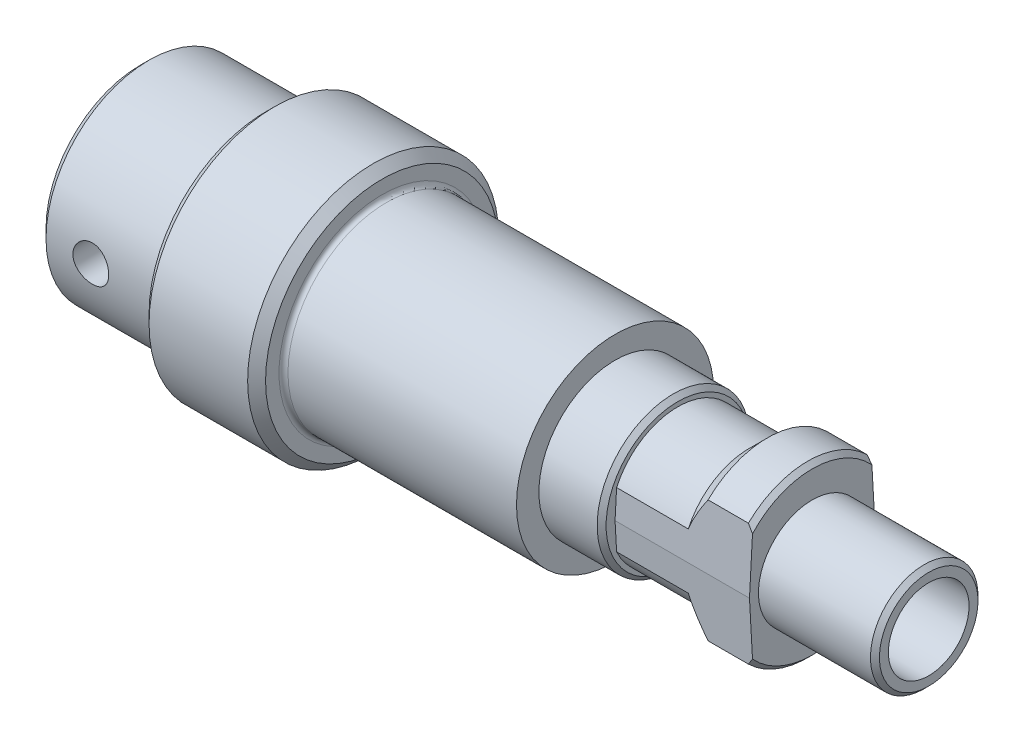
ISO-10303-21;
HEADER;
FILE_DESCRIPTION(('STEP AP214'),'2;1');
FILE_NAME('part.step','',(''),(''),'','','');
FILE_SCHEMA(('AUTOMOTIVE_DESIGN { 1 0 10303 214 1 1 1 1 }'));
ENDSEC;
DATA;
#1=APPLICATION_CONTEXT('core data for automotive mechanical design processes');
#2=APPLICATION_PROTOCOL_DEFINITION('international standard','automotive_design',2000,#1);
#3=PRODUCT_CONTEXT('',#1,'mechanical');
#4=PRODUCT('Part','Part','',(#3));
#5=PRODUCT_RELATED_PRODUCT_CATEGORY('part','',(#4));
#6=PRODUCT_DEFINITION_FORMATION('','',#4);
#7=PRODUCT_DEFINITION_CONTEXT('part definition',#1,'design');
#8=PRODUCT_DEFINITION('design','',#6,#7);
#9=PRODUCT_DEFINITION_SHAPE('','',#8);
#10=(LENGTH_UNIT() NAMED_UNIT(*) SI_UNIT(.MILLI.,.METRE.));
#11=(NAMED_UNIT(*) PLANE_ANGLE_UNIT() SI_UNIT($,.RADIAN.));
#12=(NAMED_UNIT(*) SI_UNIT($,.STERADIAN.) SOLID_ANGLE_UNIT());
#13=UNCERTAINTY_MEASURE_WITH_UNIT(LENGTH_MEASURE(1.E-05),#10,'distance_accuracy_value','');
#14=(GEOMETRIC_REPRESENTATION_CONTEXT(3) GLOBAL_UNCERTAINTY_ASSIGNED_CONTEXT((#13)) GLOBAL_UNIT_ASSIGNED_CONTEXT((#10,
#11,#12)) REPRESENTATION_CONTEXT('',''));
#15=CARTESIAN_POINT('',(0.,0.,0.));
#16=DIRECTION('',(0.,0.,1.));
#17=DIRECTION('',(1.,0.,0.));
#18=AXIS2_PLACEMENT_3D('',#15,#16,#17);
#19=CARTESIAN_POINT('',(11.,0.,0.));
#20=DIRECTION('',(1.,0.,0.));
#21=DIRECTION('',(0.,0.,-1.));
#22=AXIS2_PLACEMENT_3D('',#19,#20,#21);
#23=CYLINDRICAL_SURFACE('',#22,9.5);
#24=CARTESIAN_POINT('',(-13.5,0.,0.));
#25=DIRECTION('',(1.,0.,0.));
#26=DIRECTION('',(0.,0.,-1.));
#27=AXIS2_PLACEMENT_3D('',#24,#25,#26);
#28=CIRCLE('',#27,9.5);
#29=CARTESIAN_POINT('',(-13.5,6.81212864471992,6.62154840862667));
#30=VERTEX_POINT('',#29);
#31=CARTESIAN_POINT('',(-13.5,6.81212864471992,-6.62154840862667));
#32=VERTEX_POINT('',#31);
#33=EDGE_CURVE('E293',#30,#32,#28,.F.);
#34=ORIENTED_EDGE('',*,*,#33,.T.);
#35=DIRECTION('',(1.,0.,0.));
#36=VECTOR('',#35,1.);
#37=CARTESIAN_POINT('',(11.,6.81212864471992,-6.62154840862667));
#38=LINE('',#37,#36);
#39=CARTESIAN_POINT('',(-18.,6.81212864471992,-6.62154840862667));
#40=VERTEX_POINT('',#39);
#41=EDGE_CURVE('E54',#32,#40,#38,.F.);
#42=ORIENTED_EDGE('',*,*,#41,.T.);
#43=CARTESIAN_POINT('',(-18.,0.,0.));
#44=DIRECTION('',(1.,0.,0.));
#45=DIRECTION('',(0.,0.,-1.));
#46=AXIS2_PLACEMENT_3D('',#43,#44,#45);
#47=CIRCLE('',#46,9.5);
#48=CARTESIAN_POINT('',(-18.,6.81212864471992,6.62154840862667));
#49=VERTEX_POINT('',#48);
#50=EDGE_CURVE('E247',#40,#49,#47,.T.);
#51=ORIENTED_EDGE('',*,*,#50,.T.);
#52=DIRECTION('',(1.,0.,0.));
#53=VECTOR('',#52,1.);
#54=CARTESIAN_POINT('',(11.,6.81212864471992,6.62154840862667));
#55=LINE('',#54,#53);
#56=EDGE_CURVE('E472',#30,#49,#55,.F.);
#57=ORIENTED_EDGE('',*,*,#56,.F.);
#58=EDGE_LOOP('',(#34,#42,#51,#57));
#59=FACE_BOUND('',#58,.T.);
#60=ADVANCED_FACE('F33',(#59),#23,.T.);
#61=CARTESIAN_POINT('',(-18.,0.,0.));
#62=DIRECTION('',(1.,0.,0.));
#63=DIRECTION('',(0.,0.,-1.));
#64=AXIS2_PLACEMENT_3D('',#61,#62,#63);
#65=CONICAL_SURFACE('',#64,9.5,0.785398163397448);
#66=ORIENTED_EDGE('',*,*,#50,.F.);
#67=CARTESIAN_POINT('',(-17.9998,6.81242347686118,-6.62153202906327));
#68=CARTESIAN_POINT('',(-18.0987129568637,6.66658925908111,-6.62963393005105));
#69=CARTESIAN_POINT('',(-18.1964019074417,6.51991550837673,-6.63778247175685));
#70=CARTESIAN_POINT('',(-18.3889047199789,6.22467303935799,-6.65418483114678));
#71=CARTESIAN_POINT('',(-18.4837181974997,6.07610407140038,-6.66243866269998));
#72=CARTESIAN_POINT('',(-18.6696726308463,5.77744614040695,-6.67903076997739));
#73=CARTESIAN_POINT('',(-18.7608258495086,5.6273648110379,-6.687368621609));
#74=CARTESIAN_POINT('',(-18.9392863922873,5.32493163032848,-6.70417046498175));
#75=CARTESIAN_POINT('',(-19.0265936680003,5.17257975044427,-6.71263445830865));
#76=CARTESIAN_POINT('',(-19.1968475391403,4.86515954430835,-6.72971335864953));
#77=CARTESIAN_POINT('',(-19.2797874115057,4.71008749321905,-6.73832847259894));
#78=CARTESIAN_POINT('',(-19.4403847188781,4.39726016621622,-6.75570776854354));
#79=CARTESIAN_POINT('',(-19.5180429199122,4.23950528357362,-6.76447192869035));
#80=CARTESIAN_POINT('',(-19.6674638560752,3.92052296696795,-6.78219316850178));
#81=CARTESIAN_POINT('',(-19.7392043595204,3.75928507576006,-6.79115082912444));
#82=CARTESIAN_POINT('',(-19.8754302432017,3.43368707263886,-6.80923960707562));
#83=CARTESIAN_POINT('',(-19.9399116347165,3.26932530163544,-6.81837081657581));
#84=CARTESIAN_POINT('',(-20.0002,3.10338870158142,-6.82758951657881));
#85=B_SPLINE_CURVE_WITH_KNOTS('',3,(#67,#68,#69,#70,#71,#72,#73,#74,#75,#76,#77,#78,#79,#80,#81,
#82,#83,#84),.UNSPECIFIED.,.F.,.F.,(4,2,2,2,2,2,2,2,4),(0.,0.529209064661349,1.05848857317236,
1.58581464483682,2.11314735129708,2.64126941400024,3.16931471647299,3.69926110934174,
4.22949728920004),.UNSPECIFIED.);
#86=CARTESIAN_POINT('',(-20.,3.10393928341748,-6.82755892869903));
#87=VERTEX_POINT('',#86);
#88=EDGE_CURVE('E184',#40,#87,#85,.T.);
#89=ORIENTED_EDGE('',*,*,#88,.T.);
#90=CARTESIAN_POINT('',(-20.,0.,0.));
#91=DIRECTION('',(1.,0.,0.));
#92=DIRECTION('',(0.,0.,-1.));
#93=AXIS2_PLACEMENT_3D('',#90,#91,#92);
#94=CIRCLE('',#93,7.5);
#95=CARTESIAN_POINT('',(-20.,3.10393928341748,6.82755892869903));
#96=VERTEX_POINT('',#95);
#97=EDGE_CURVE('E243',#87,#96,#94,.T.);
#98=ORIENTED_EDGE('',*,*,#97,.T.);
#99=CARTESIAN_POINT('',(-17.9998,6.81242347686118,6.62153202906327));
#100=CARTESIAN_POINT('',(-18.0987129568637,6.66658925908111,6.62963393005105));
#101=CARTESIAN_POINT('',(-18.1964019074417,6.51991550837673,6.63778247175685));
#102=CARTESIAN_POINT('',(-18.3889047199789,6.22467303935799,6.65418483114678));
#103=CARTESIAN_POINT('',(-18.4837181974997,6.07610407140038,6.66243866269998));
#104=CARTESIAN_POINT('',(-18.6696726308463,5.77744614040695,6.67903076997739));
#105=CARTESIAN_POINT('',(-18.7608258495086,5.6273648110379,6.687368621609));
#106=CARTESIAN_POINT('',(-18.9392863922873,5.32493163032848,6.70417046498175));
#107=CARTESIAN_POINT('',(-19.0265936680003,5.17257975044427,6.71263445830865));
#108=CARTESIAN_POINT('',(-19.1968475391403,4.86515954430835,6.72971335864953));
#109=CARTESIAN_POINT('',(-19.2797874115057,4.71008749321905,6.73832847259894));
#110=CARTESIAN_POINT('',(-19.4403847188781,4.39726016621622,6.75570776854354));
#111=CARTESIAN_POINT('',(-19.5180429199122,4.23950528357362,6.76447192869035));
#112=CARTESIAN_POINT('',(-19.6674638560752,3.92052296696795,6.78219316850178));
#113=CARTESIAN_POINT('',(-19.7392043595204,3.75928507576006,6.79115082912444));
#114=CARTESIAN_POINT('',(-19.8754302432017,3.43368707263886,6.80923960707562));
#115=CARTESIAN_POINT('',(-19.9399116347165,3.26932530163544,6.81837081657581));
#116=CARTESIAN_POINT('',(-20.0002,3.10338870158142,6.82758951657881));
#117=B_SPLINE_CURVE_WITH_KNOTS('',3,(#99,#100,#101,#102,#103,#104,#105,#106,#107,#108,#109,#110,
#111,#112,#113,#114,#115,#116),.UNSPECIFIED.,.F.,.F.,(4,2,2,2,2,2,2,2,4),(0.,0.52920906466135,
1.05848857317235,1.58581464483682,2.11314735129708,2.64126941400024,3.16931471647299,
3.69926110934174,4.22949728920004),.UNSPECIFIED.);
#118=EDGE_CURVE('E207',#49,#96,#117,.T.);
#119=ORIENTED_EDGE('',*,*,#118,.F.);
#120=EDGE_LOOP('',(#66,#89,#98,#119));
#121=FACE_BOUND('',#120,.T.);
#122=ADVANCED_FACE('F201',(#121),#65,.T.);
#123=CARTESIAN_POINT('',(11.,0.,0.));
#124=DIRECTION('',(1.,0.,0.));
#125=DIRECTION('',(0.,0.,-1.));
#126=AXIS2_PLACEMENT_3D('',#123,#124,#125);
#127=CYLINDRICAL_SURFACE('',#126,7.5);
#128=ORIENTED_EDGE('',*,*,#97,.F.);
#129=DIRECTION('',(1.,0.,0.));
#130=VECTOR('',#129,1.);
#131=CARTESIAN_POINT('',(11.,3.10393928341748,-6.82755892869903));
#132=LINE('',#131,#130);
#133=CARTESIAN_POINT('',(-28.,3.10393928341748,-6.82755892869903));
#134=VERTEX_POINT('',#133);
#135=EDGE_CURVE('E191',#87,#134,#132,.F.);
#136=ORIENTED_EDGE('',*,*,#135,.T.);
#137=CARTESIAN_POINT('',(-28.,0.,0.));
#138=DIRECTION('',(1.,0.,0.));
#139=DIRECTION('',(0.,0.,-1.));
#140=AXIS2_PLACEMENT_3D('',#137,#138,#139);
#141=CIRCLE('',#140,7.5);
#142=CARTESIAN_POINT('',(-28.,3.10393928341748,6.82755892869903));
#143=VERTEX_POINT('',#142);
#144=EDGE_CURVE('E239',#134,#143,#141,.T.);
#145=ORIENTED_EDGE('',*,*,#144,.T.);
#146=DIRECTION('',(1.,0.,0.));
#147=VECTOR('',#146,1.);
#148=CARTESIAN_POINT('',(11.,3.10393928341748,6.82755892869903));
#149=LINE('',#148,#147);
#150=EDGE_CURVE('E468',#96,#143,#149,.F.);
#151=ORIENTED_EDGE('',*,*,#150,.F.);
#152=EDGE_LOOP('',(#128,#136,#145,#151));
#153=FACE_BOUND('',#152,.T.);
#154=ADVANCED_FACE('F335',(#153),#127,.T.);
#155=CARTESIAN_POINT('',(-13.,0.,0.));
#156=DIRECTION('',(-1.,0.,0.));
#157=DIRECTION('',(0.,0.,1.));
#158=AXIS2_PLACEMENT_3D('',#155,#156,#157);
#159=CONICAL_SURFACE('',#158,8.99999999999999,0.78539816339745);
#160=CARTESIAN_POINT('',(-13.,0.,0.));
#161=DIRECTION('',(1.,0.,0.));
#162=DIRECTION('',(0.,0.,-1.));
#163=AXIS2_PLACEMENT_3D('',#160,#161,#162);
#164=CIRCLE('',#163,8.99999999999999);
#165=CARTESIAN_POINT('',(-13.,6.04912708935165,-6.66393738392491));
#166=VERTEX_POINT('',#165);
#167=CARTESIAN_POINT('',(-13.,6.04912708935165,6.66393738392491));
#168=VERTEX_POINT('',#167);
#169=EDGE_CURVE('E62',#166,#168,#164,.T.);
#170=ORIENTED_EDGE('',*,*,#169,.F.);
#171=CARTESIAN_POINT('',(-12.9998,6.04881012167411,-6.66395499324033));
#172=CARTESIAN_POINT('',(-13.0404012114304,6.11315674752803,-6.66038018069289));
#173=CARTESIAN_POINT('',(-13.0813003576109,6.17731554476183,-6.65681580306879));
#174=CARTESIAN_POINT('',(-13.1636569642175,6.30526875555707,-6.64970729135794));
#175=CARTESIAN_POINT('',(-13.2051143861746,6.36906319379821,-6.6461631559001));
#176=CARTESIAN_POINT('',(-13.2885553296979,6.49630741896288,-6.63909403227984));
#177=CARTESIAN_POINT('',(-13.3305388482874,6.55975720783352,-6.63556904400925));
#178=CARTESIAN_POINT('',(-13.4150041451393,6.68633162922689,-6.62853713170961));
#179=CARTESIAN_POINT('',(-13.4574859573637,6.74945623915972,-6.62503020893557));
#180=CARTESIAN_POINT('',(-13.5002,6.81242347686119,-6.62153202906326));
#181=B_SPLINE_CURVE_WITH_KNOTS('',3,(#171,#172,#173,#174,#175,#176,#177,#178,#179,#180),
.UNSPECIFIED.,.F.,.F.,(4,2,2,2,4),(0.,0.228505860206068,0.45699605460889,0.685484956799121,
0.913989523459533),.UNSPECIFIED.);
#182=EDGE_CURVE('E138',#166,#32,#181,.T.);
#183=ORIENTED_EDGE('',*,*,#182,.T.);
#184=ORIENTED_EDGE('',*,*,#33,.F.);
#185=CARTESIAN_POINT('',(-12.9998,6.04881012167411,6.66395499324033));
#186=CARTESIAN_POINT('',(-13.0404012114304,6.11315674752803,6.66038018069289));
#187=CARTESIAN_POINT('',(-13.0813003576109,6.17731554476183,6.65681580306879));
#188=CARTESIAN_POINT('',(-13.1636569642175,6.30526875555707,6.64970729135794));
#189=CARTESIAN_POINT('',(-13.2051143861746,6.36906319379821,6.6461631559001));
#190=CARTESIAN_POINT('',(-13.2885553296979,6.49630741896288,6.63909403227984));
#191=CARTESIAN_POINT('',(-13.3305388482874,6.55975720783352,6.63556904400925));
#192=CARTESIAN_POINT('',(-13.4150041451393,6.68633162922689,6.62853713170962));
#193=CARTESIAN_POINT('',(-13.4574859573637,6.74945623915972,6.62503020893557));
#194=CARTESIAN_POINT('',(-13.5002,6.81242347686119,6.62153202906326));
#195=B_SPLINE_CURVE_WITH_KNOTS('',3,(#185,#186,#187,#188,#189,#190,#191,#192,#193,#194),
.UNSPECIFIED.,.F.,.F.,(4,2,2,2,4),(0.,0.228505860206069,0.456996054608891,0.685484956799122,
0.913989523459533),.UNSPECIFIED.);
#196=EDGE_CURVE('E302',#168,#30,#195,.T.);
#197=ORIENTED_EDGE('',*,*,#196,.F.);
#198=EDGE_LOOP('',(#170,#183,#184,#197));
#199=FACE_BOUND('',#198,.T.);
#200=ADVANCED_FACE('F342',(#199),#159,.T.);
#201=CARTESIAN_POINT('',(-13.,6.,0.));
#202=DIRECTION('',(1.,0.,0.));
#203=DIRECTION('',(0.,0.,-1.));
#204=AXIS2_PLACEMENT_3D('',#201,#202,#203);
#205=PLANE('',#204);
#206=DIRECTION('',(0.,-0.998460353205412,0.0554700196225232));
#207=VECTOR('',#206,1.);
#208=CARTESIAN_POINT('',(-13.,0.,-7.));
#209=LINE('',#208,#207);
#210=CARTESIAN_POINT('',(-13.,0.,-7.));
#211=VERTEX_POINT('',#210);
#212=CARTESIAN_POINT('',(-13.,-6.04912708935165,-6.66393738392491));
#213=VERTEX_POINT('',#212);
#214=EDGE_CURVE('E133',#211,#213,#209,.T.);
#215=ORIENTED_EDGE('',*,*,#214,.F.);
#216=DIRECTION('',(0.,0.998460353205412,0.0554700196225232));
#217=VECTOR('',#216,1.);
#218=CARTESIAN_POINT('',(-13.,0.,-7.));
#219=LINE('',#218,#217);
#220=EDGE_CURVE('E141',#211,#166,#219,.T.);
#221=ORIENTED_EDGE('',*,*,#220,.T.);
#222=ORIENTED_EDGE('',*,*,#169,.T.);
#223=DIRECTION('',(0.,0.998460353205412,-0.0554700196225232));
#224=VECTOR('',#223,1.);
#225=CARTESIAN_POINT('',(-13.,0.,7.));
#226=LINE('',#225,#224);
#227=CARTESIAN_POINT('',(-13.,0.,7.));
#228=VERTEX_POINT('',#227);
#229=EDGE_CURVE('E480',#228,#168,#226,.T.);
#230=ORIENTED_EDGE('',*,*,#229,.F.);
#231=DIRECTION('',(0.,-0.998460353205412,-0.0554700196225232));
#232=VECTOR('',#231,1.);
#233=CARTESIAN_POINT('',(-13.,0.,7.));
#234=LINE('',#233,#232);
#235=CARTESIAN_POINT('',(-13.,-6.04912708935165,6.66393738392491));
#236=VERTEX_POINT('',#235);
#237=EDGE_CURVE('E482',#228,#236,#234,.T.);
#238=ORIENTED_EDGE('',*,*,#237,.T.);
#239=EDGE_CURVE('E149',#236,#213,#164,.T.);
#240=ORIENTED_EDGE('',*,*,#239,.T.);
#241=EDGE_LOOP('',(#215,#221,#222,#230,#238,#240));
#242=FACE_BOUND('',#241,.T.);
#243=CARTESIAN_POINT('',(-13.,0.,0.));
#244=DIRECTION('',(1.,0.,0.));
#245=DIRECTION('',(0.,0.,-1.));
#246=AXIS2_PLACEMENT_3D('',#243,#244,#245);
#247=CIRCLE('',#246,6.);
#248=CARTESIAN_POINT('',(-13.,0.,-6.));
#249=VERTEX_POINT('',#248);
#250=EDGE_CURVE('E251',#249,#249,#247,.T.);
#251=ORIENTED_EDGE('',*,*,#250,.F.);
#252=EDGE_LOOP('',(#251));
#253=FACE_BOUND('',#252,.T.);
#254=ADVANCED_FACE('F145',(#242,#253),#205,.T.);
#255=DIRECTION('',(1.,0.,0.));
#256=VECTOR('',#255,1.);
#257=CARTESIAN_POINT('',(11.,-6.81212864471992,-6.62154840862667));
#258=LINE('',#257,#256);
#259=CARTESIAN_POINT('',(-13.5,-6.81212864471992,-6.62154840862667));
#260=VERTEX_POINT('',#259);
#261=CARTESIAN_POINT('',(-18.,-6.81212864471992,-6.62154840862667));
#262=VERTEX_POINT('',#261);
#263=EDGE_CURVE('E344',#260,#262,#258,.F.);
#264=ORIENTED_EDGE('',*,*,#263,.F.);
#265=CARTESIAN_POINT('',(-13.5,-6.81212864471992,6.62154840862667));
#266=VERTEX_POINT('',#265);
#267=EDGE_CURVE('E292',#260,#266,#28,.F.);
#268=ORIENTED_EDGE('',*,*,#267,.T.);
#269=DIRECTION('',(1.,0.,0.));
#270=VECTOR('',#269,1.);
#271=CARTESIAN_POINT('',(11.,-6.81212864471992,6.62154840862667));
#272=LINE('',#271,#270);
#273=CARTESIAN_POINT('',(-18.,-6.81212864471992,6.62154840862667));
#274=VERTEX_POINT('',#273);
#275=EDGE_CURVE('E224',#266,#274,#272,.F.);
#276=ORIENTED_EDGE('',*,*,#275,.T.);
#277=EDGE_CURVE('E248',#274,#262,#47,.T.);
#278=ORIENTED_EDGE('',*,*,#277,.T.);
#279=EDGE_LOOP('',(#264,#268,#276,#278));
#280=FACE_BOUND('',#279,.T.);
#281=ADVANCED_FACE('F199',(#280),#23,.T.);
#282=CARTESIAN_POINT('',(-17.9998,-6.81242347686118,-6.62153202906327));
#283=CARTESIAN_POINT('',(-18.0987129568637,-6.66658925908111,-6.62963393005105));
#284=CARTESIAN_POINT('',(-18.1964019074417,-6.51991550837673,-6.63778247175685));
#285=CARTESIAN_POINT('',(-18.3889047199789,-6.22467303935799,-6.65418483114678));
#286=CARTESIAN_POINT('',(-18.4837181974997,-6.07610407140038,-6.66243866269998));
#287=CARTESIAN_POINT('',(-18.6696726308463,-5.77744614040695,-6.67903076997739));
#288=CARTESIAN_POINT('',(-18.7608258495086,-5.62736481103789,-6.687368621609));
#289=CARTESIAN_POINT('',(-18.9392863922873,-5.32493163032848,-6.70417046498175));
#290=CARTESIAN_POINT('',(-19.0265936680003,-5.17257975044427,-6.71263445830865));
#291=CARTESIAN_POINT('',(-19.1968475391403,-4.86515954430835,-6.72971335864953));
#292=CARTESIAN_POINT('',(-19.2797874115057,-4.71008749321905,-6.73832847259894));
#293=CARTESIAN_POINT('',(-19.4403847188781,-4.39726016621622,-6.75570776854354));
#294=CARTESIAN_POINT('',(-19.5180429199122,-4.23950528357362,-6.76447192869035));
#295=CARTESIAN_POINT('',(-19.6674638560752,-3.92052296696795,-6.78219316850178));
#296=CARTESIAN_POINT('',(-19.7392043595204,-3.75928507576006,-6.79115082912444));
#297=CARTESIAN_POINT('',(-19.8754302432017,-3.43368707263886,-6.80923960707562));
#298=CARTESIAN_POINT('',(-19.9399116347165,-3.26932530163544,-6.81837081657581));
#299=CARTESIAN_POINT('',(-20.0002,-3.10338870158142,-6.82758951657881));
#300=B_SPLINE_CURVE_WITH_KNOTS('',3,(#282,#283,#284,#285,#286,#287,#288,#289,#290,#291,#292,
#293,#294,#295,#296,#297,#298,#299),.UNSPECIFIED.,.F.,.F.,(4,2,2,2,2,2,2,2,4),(0.,
0.529209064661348,1.05848857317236,1.58581464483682,2.11314735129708,2.64126941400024,
3.16931471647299,3.69926110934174,4.22949728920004),.UNSPECIFIED.);
#301=CARTESIAN_POINT('',(-20.,-3.10393928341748,-6.82755892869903));
#302=VERTEX_POINT('',#301);
#303=EDGE_CURVE('E350',#262,#302,#300,.T.);
#304=ORIENTED_EDGE('',*,*,#303,.F.);
#305=ORIENTED_EDGE('',*,*,#277,.F.);
#306=CARTESIAN_POINT('',(-17.9998,-6.81242347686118,6.62153202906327));
#307=CARTESIAN_POINT('',(-18.0987129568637,-6.66658925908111,6.62963393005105));
#308=CARTESIAN_POINT('',(-18.1964019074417,-6.51991550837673,6.63778247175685));
#309=CARTESIAN_POINT('',(-18.3889047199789,-6.22467303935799,6.65418483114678));
#310=CARTESIAN_POINT('',(-18.4837181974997,-6.07610407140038,6.66243866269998));
#311=CARTESIAN_POINT('',(-18.6696726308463,-5.77744614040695,6.67903076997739));
#312=CARTESIAN_POINT('',(-18.7608258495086,-5.6273648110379,6.687368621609));
#313=CARTESIAN_POINT('',(-18.9392863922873,-5.32493163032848,6.70417046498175));
#314=CARTESIAN_POINT('',(-19.0265936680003,-5.17257975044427,6.71263445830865));
#315=CARTESIAN_POINT('',(-19.1968475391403,-4.86515954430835,6.72971335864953));
#316=CARTESIAN_POINT('',(-19.2797874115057,-4.71008749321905,6.73832847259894));
#317=CARTESIAN_POINT('',(-19.4403847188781,-4.39726016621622,6.75570776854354));
#318=CARTESIAN_POINT('',(-19.5180429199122,-4.23950528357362,6.76447192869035));
#319=CARTESIAN_POINT('',(-19.6674638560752,-3.92052296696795,6.78219316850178));
#320=CARTESIAN_POINT('',(-19.7392043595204,-3.75928507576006,6.79115082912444));
#321=CARTESIAN_POINT('',(-19.8754302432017,-3.43368707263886,6.80923960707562));
#322=CARTESIAN_POINT('',(-19.9399116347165,-3.26932530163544,6.81837081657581));
#323=CARTESIAN_POINT('',(-20.0002,-3.10338870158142,6.82758951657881));
#324=B_SPLINE_CURVE_WITH_KNOTS('',3,(#306,#307,#308,#309,#310,#311,#312,#313,#314,#315,#316,
#317,#318,#319,#320,#321,#322,#323),.UNSPECIFIED.,.F.,.F.,(4,2,2,2,2,2,2,2,4),(0.,
0.529209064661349,1.05848857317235,1.58581464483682,2.11314735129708,2.64126941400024,
3.16931471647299,3.69926110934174,4.22949728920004),.UNSPECIFIED.);
#325=CARTESIAN_POINT('',(-20.,-3.10393928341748,6.82755892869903));
#326=VERTEX_POINT('',#325);
#327=EDGE_CURVE('E216',#274,#326,#324,.T.);
#328=ORIENTED_EDGE('',*,*,#327,.T.);
#329=EDGE_CURVE('E244',#326,#302,#94,.T.);
#330=ORIENTED_EDGE('',*,*,#329,.T.);
#331=EDGE_LOOP('',(#304,#305,#328,#330));
#332=FACE_BOUND('',#331,.T.);
#333=ADVANCED_FACE('F193',(#332),#65,.T.);
#334=DIRECTION('',(1.,0.,0.));
#335=VECTOR('',#334,1.);
#336=CARTESIAN_POINT('',(11.,-3.10393928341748,-6.82755892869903));
#337=LINE('',#336,#335);
#338=CARTESIAN_POINT('',(-28.,-3.10393928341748,-6.82755892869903));
#339=VERTEX_POINT('',#338);
#340=EDGE_CURVE('E484',#302,#339,#337,.F.);
#341=ORIENTED_EDGE('',*,*,#340,.F.);
#342=ORIENTED_EDGE('',*,*,#329,.F.);
#343=DIRECTION('',(1.,0.,0.));
#344=VECTOR('',#343,1.);
#345=CARTESIAN_POINT('',(11.,-3.10393928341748,6.82755892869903));
#346=LINE('',#345,#344);
#347=CARTESIAN_POINT('',(-28.,-3.10393928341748,6.82755892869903));
#348=VERTEX_POINT('',#347);
#349=EDGE_CURVE('E223',#326,#348,#346,.F.);
#350=ORIENTED_EDGE('',*,*,#349,.T.);
#351=EDGE_CURVE('E240',#348,#339,#141,.T.);
#352=ORIENTED_EDGE('',*,*,#351,.T.);
#353=EDGE_LOOP('',(#341,#342,#350,#352));
#354=FACE_BOUND('',#353,.T.);
#355=ADVANCED_FACE('F198',(#354),#127,.T.);
#356=CARTESIAN_POINT('',(-12.9998,-6.04881012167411,-6.66395499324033));
#357=CARTESIAN_POINT('',(-13.0404012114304,-6.11315674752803,-6.66038018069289));
#358=CARTESIAN_POINT('',(-13.0813003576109,-6.17731554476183,-6.65681580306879));
#359=CARTESIAN_POINT('',(-13.1636569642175,-6.30526875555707,-6.64970729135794));
#360=CARTESIAN_POINT('',(-13.2051143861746,-6.36906319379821,-6.6461631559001));
#361=CARTESIAN_POINT('',(-13.2885553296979,-6.49630741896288,-6.63909403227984));
#362=CARTESIAN_POINT('',(-13.3305388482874,-6.55975720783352,-6.63556904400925));
#363=CARTESIAN_POINT('',(-13.4150041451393,-6.68633162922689,-6.62853713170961));
#364=CARTESIAN_POINT('',(-13.4574859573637,-6.74945623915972,-6.62503020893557));
#365=CARTESIAN_POINT('',(-13.5002,-6.81242347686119,-6.62153202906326));
#366=B_SPLINE_CURVE_WITH_KNOTS('',3,(#356,#357,#358,#359,#360,#361,#362,#363,#364,#365),
.UNSPECIFIED.,.F.,.F.,(4,2,2,2,4),(0.,0.228505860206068,0.45699605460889,0.685484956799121,
0.913989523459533),.UNSPECIFIED.);
#367=EDGE_CURVE('E351',#213,#260,#366,.T.);
#368=ORIENTED_EDGE('',*,*,#367,.F.);
#369=ORIENTED_EDGE('',*,*,#239,.F.);
#370=CARTESIAN_POINT('',(-12.9998,-6.04881012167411,6.66395499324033));
#371=CARTESIAN_POINT('',(-13.0404012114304,-6.11315674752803,6.66038018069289));
#372=CARTESIAN_POINT('',(-13.0813003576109,-6.17731554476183,6.65681580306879));
#373=CARTESIAN_POINT('',(-13.1636569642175,-6.30526875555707,6.64970729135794));
#374=CARTESIAN_POINT('',(-13.2051143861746,-6.36906319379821,6.6461631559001));
#375=CARTESIAN_POINT('',(-13.2885553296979,-6.49630741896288,6.63909403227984));
#376=CARTESIAN_POINT('',(-13.3305388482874,-6.55975720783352,6.63556904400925));
#377=CARTESIAN_POINT('',(-13.4150041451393,-6.68633162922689,6.62853713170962));
#378=CARTESIAN_POINT('',(-13.4574859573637,-6.74945623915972,6.62503020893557));
#379=CARTESIAN_POINT('',(-13.5002,-6.81242347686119,6.62153202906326));
#380=B_SPLINE_CURVE_WITH_KNOTS('',3,(#370,#371,#372,#373,#374,#375,#376,#377,#378,#379),
.UNSPECIFIED.,.F.,.F.,(4,2,2,2,4),(0.,0.228505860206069,0.456996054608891,0.685484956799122,
0.913989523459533),.UNSPECIFIED.);
#381=EDGE_CURVE('E307',#236,#266,#380,.T.);
#382=ORIENTED_EDGE('',*,*,#381,.T.);
#383=ORIENTED_EDGE('',*,*,#267,.F.);
#384=EDGE_LOOP('',(#368,#369,#382,#383));
#385=FACE_BOUND('',#384,.T.);
#386=ADVANCED_FACE('F169',(#385),#159,.T.);
#387=CARTESIAN_POINT('',(11.,0.,0.));
#388=DIRECTION('',(1.,0.,0.));
#389=DIRECTION('',(0.,0.,-1.));
#390=AXIS2_PLACEMENT_3D('',#387,#388,#389);
#391=CYLINDRICAL_SURFACE('',#390,14.);
#392=CARTESIAN_POINT('',(-62.,0.,0.));
#393=DIRECTION('',(1.,0.,0.));
#394=DIRECTION('',(0.,0.,-1.));
#395=AXIS2_PLACEMENT_3D('',#392,#393,#394);
#396=CIRCLE('',#395,14.);
#397=CARTESIAN_POINT('',(-62.,0.,-14.));
#398=VERTEX_POINT('',#397);
#399=EDGE_CURVE('E272',#398,#398,#396,.F.);
#400=ORIENTED_EDGE('',*,*,#399,.T.);
#401=EDGE_LOOP('',(#400));
#402=FACE_BOUND('',#401,.T.);
#403=CARTESIAN_POINT('',(-73.,0.,0.));
#404=DIRECTION('',(-1.,0.,0.));
#405=DIRECTION('',(0.,0.,1.));
#406=AXIS2_PLACEMENT_3D('',#403,#404,#405);
#407=CIRCLE('',#406,14.);
#408=CARTESIAN_POINT('',(-73.,0.,14.));
#409=VERTEX_POINT('',#408);
#410=EDGE_CURVE('E269',#409,#409,#407,.F.);
#411=ORIENTED_EDGE('',*,*,#410,.T.);
#412=EDGE_LOOP('',(#411));
#413=FACE_BOUND('',#412,.T.);
#414=ADVANCED_FACE('F35',(#402,#413),#391,.T.);
#415=CARTESIAN_POINT('',(-74.,14.,0.));
#416=DIRECTION('',(-1.,0.,0.));
#417=DIRECTION('',(0.,0.,1.));
#418=AXIS2_PLACEMENT_3D('',#415,#416,#417);
#419=PLANE('',#418);
#420=CARTESIAN_POINT('',(-74.,0.,0.));
#421=DIRECTION('',(-1.,0.,0.));
#422=DIRECTION('',(0.,0.,1.));
#423=AXIS2_PLACEMENT_3D('',#420,#421,#422);
#424=CIRCLE('',#423,13.);
#425=CARTESIAN_POINT('',(-74.,0.,13.));
#426=VERTEX_POINT('',#425);
#427=EDGE_CURVE('E276',#426,#426,#424,.T.);
#428=ORIENTED_EDGE('',*,*,#427,.T.);
#429=EDGE_LOOP('',(#428));
#430=FACE_BOUND('',#429,.T.);
#431=CARTESIAN_POINT('',(-74.,0.,0.));
#432=DIRECTION('',(1.,0.,0.));
#433=DIRECTION('',(0.,0.,-1.));
#434=AXIS2_PLACEMENT_3D('',#431,#432,#433);
#435=CIRCLE('',#434,11.5);
#436=CARTESIAN_POINT('',(-74.,0.,-11.5));
#437=VERTEX_POINT('',#436);
#438=EDGE_CURVE('E263',#437,#437,#435,.T.);
#439=ORIENTED_EDGE('',*,*,#438,.T.);
#440=EDGE_LOOP('',(#439));
#441=FACE_BOUND('',#440,.T.);
#442=ADVANCED_FACE('F397',(#430,#441),#419,.T.);
#443=CARTESIAN_POINT('',(11.,0.,0.));
#444=DIRECTION('',(1.,0.,0.));
#445=DIRECTION('',(0.,0.,-1.));
#446=AXIS2_PLACEMENT_3D('',#443,#444,#445);
#447=CYLINDRICAL_SURFACE('',#446,11.5);
#448=CARTESIAN_POINT('',(-84.,0.,-11.5));
#449=CARTESIAN_POINT('',(-83.999995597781,0.111439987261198,-11.4999980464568));
#450=CARTESIAN_POINT('',(-83.9906543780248,0.22293898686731,-11.4983633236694));
#451=CARTESIAN_POINT('',(-83.9535546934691,0.442804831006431,-11.4919995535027));
#452=CARTESIAN_POINT('',(-83.9257797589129,0.551168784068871,-11.4872677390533));
#453=CARTESIAN_POINT('',(-83.8526807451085,0.761552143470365,-11.47524004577));
#454=CARTESIAN_POINT('',(-83.8073715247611,0.863576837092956,-11.4679463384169));
#455=CARTESIAN_POINT('',(-83.7005301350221,1.05856414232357,-11.4515949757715));
#456=CARTESIAN_POINT('',(-83.6389996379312,1.15152768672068,-11.4425375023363));
#457=CARTESIAN_POINT('',(-83.500783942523,1.32672978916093,-11.4235561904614));
#458=CARTESIAN_POINT('',(-83.4239633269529,1.40886074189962,-11.4136250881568));
#459=CARTESIAN_POINT('',(-83.2576394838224,1.55913628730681,-11.3940708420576));
#460=CARTESIAN_POINT('',(-83.1681354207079,1.6272799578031,-11.3844477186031));
#461=CARTESIAN_POINT('',(-82.978238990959,1.74808334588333,-11.366528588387));
#462=CARTESIAN_POINT('',(-82.8777773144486,1.80063562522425,-11.3582419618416));
#463=CARTESIAN_POINT('',(-82.6692837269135,1.88807717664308,-11.344035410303));
#464=CARTESIAN_POINT('',(-82.5612523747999,1.92296775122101,-11.338115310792));
#465=CARTESIAN_POINT('',(-82.3418304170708,1.97375430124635,-11.3293847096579));
#466=CARTESIAN_POINT('',(-82.2304841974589,1.98983670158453,-11.3265437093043));
#467=CARTESIAN_POINT('',(-82.0066402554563,2.00312861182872,-11.3242008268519));
#468=CARTESIAN_POINT('',(-81.8941426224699,2.00033957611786,-11.3246986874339));
#469=CARTESIAN_POINT('',(-81.6725266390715,1.97611940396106,-11.3289494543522));
#470=CARTESIAN_POINT('',(-81.5633845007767,1.95489854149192,-11.332665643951));
#471=CARTESIAN_POINT('',(-81.3502336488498,1.89474747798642,-11.3428768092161));
#472=CARTESIAN_POINT('',(-81.2462251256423,1.85581662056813,-11.3493718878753));
#473=CARTESIAN_POINT('',(-81.0456692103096,1.76114002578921,-11.3644482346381));
#474=CARTESIAN_POINT('',(-80.9491634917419,1.70530778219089,-11.3730401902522));
#475=CARTESIAN_POINT('',(-80.7668108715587,1.57847462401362,-11.3913348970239));
#476=CARTESIAN_POINT('',(-80.6809649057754,1.50747237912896,-11.4010377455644));
#477=CARTESIAN_POINT('',(-80.5211522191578,1.35117304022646,-11.4206218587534));
#478=CARTESIAN_POINT('',(-80.4473617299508,1.26569571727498,-11.4305037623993));
#479=CARTESIAN_POINT('',(-80.3151433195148,1.08347997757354,-11.4492115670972));
#480=CARTESIAN_POINT('',(-80.2567155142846,0.986741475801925,-11.4580374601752));
#481=CARTESIAN_POINT('',(-80.1568616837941,0.784577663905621,-11.4736530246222));
#482=CARTESIAN_POINT('',(-80.1154521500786,0.6791440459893,-11.4804407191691));
#483=CARTESIAN_POINT('',(-80.0509787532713,0.462673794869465,-11.4911994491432));
#484=CARTESIAN_POINT('',(-80.0279132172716,0.351637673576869,-11.4951707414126));
#485=CARTESIAN_POINT('',(-80.0010236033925,0.128632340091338,-11.4998144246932));
#486=CARTESIAN_POINT('',(-79.9969577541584,0.0166931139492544,-11.5005282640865));
#487=CARTESIAN_POINT('',(-80.0075370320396,-0.206266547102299,-11.4986904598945));
#488=CARTESIAN_POINT('',(-80.0221813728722,-0.317287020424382,-11.4961389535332));
#489=CARTESIAN_POINT('',(-80.069564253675,-0.534504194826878,-11.4880828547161));
#490=CARTESIAN_POINT('',(-80.1021822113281,-0.640727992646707,-11.4825979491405));
#491=CARTESIAN_POINT('',(-80.1844572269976,-0.846199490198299,-11.469287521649));
#492=CARTESIAN_POINT('',(-80.2341153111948,-0.945446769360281,-11.461461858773));
#493=CARTESIAN_POINT('',(-80.3496084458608,-1.13519201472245,-11.4442348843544));
#494=CARTESIAN_POINT('',(-80.4155934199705,-1.22559739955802,-11.4348192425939));
#495=CARTESIAN_POINT('',(-80.5616621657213,-1.39413850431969,-11.4154976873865));
#496=CARTESIAN_POINT('',(-80.6417470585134,-1.47227324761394,-11.4055917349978));
#497=CARTESIAN_POINT('',(-80.8148301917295,-1.61495889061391,-11.3862708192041));
#498=CARTESIAN_POINT('',(-80.9079644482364,-1.67934587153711,-11.376862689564));
#499=CARTESIAN_POINT('',(-81.10386904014,-1.79156091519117,-11.3597334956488));
#500=CARTESIAN_POINT('',(-81.2066390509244,-1.83938953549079,-11.3520123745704));
#501=CARTESIAN_POINT('',(-81.4184537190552,-1.91688925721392,-11.3391834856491));
#502=CARTESIAN_POINT('',(-81.5274685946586,-1.9466397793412,-11.3340643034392));
#503=CARTESIAN_POINT('',(-81.7490454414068,-1.98738717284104,-11.3269910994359));
#504=CARTESIAN_POINT('',(-81.8616070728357,-1.99838583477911,-11.3250367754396));
#505=CARTESIAN_POINT('',(-82.0854437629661,-2.00126398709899,-11.3245283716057));
#506=CARTESIAN_POINT('',(-82.1967154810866,-1.99340166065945,-11.3259283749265));
#507=CARTESIAN_POINT('',(-82.4163264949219,-1.95934163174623,-11.3318698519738));
#508=CARTESIAN_POINT('',(-82.5246658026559,-1.93314400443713,-11.3364113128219));
#509=CARTESIAN_POINT('',(-82.7352236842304,-1.86325935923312,-11.3481059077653));
#510=CARTESIAN_POINT('',(-82.83745048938,-1.81959649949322,-11.3552554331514));
#511=CARTESIAN_POINT('',(-83.0331694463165,-1.71604786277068,-11.3713637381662));
#512=CARTESIAN_POINT('',(-83.126661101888,-1.65616116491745,-11.3803226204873));
#513=CARTESIAN_POINT('',(-83.3035566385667,-1.52095132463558,-11.3991847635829));
#514=CARTESIAN_POINT('',(-83.3868147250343,-1.44543890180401,-11.409098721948));
#515=CARTESIAN_POINT('',(-83.5395654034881,-1.28151898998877,-11.4286704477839));
#516=CARTESIAN_POINT('',(-83.6090548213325,-1.19310853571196,-11.438328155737));
#517=CARTESIAN_POINT('',(-83.7327815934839,-1.00510213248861,-11.4563845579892));
#518=CARTESIAN_POINT('',(-83.7868991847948,-0.905426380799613,-11.4647731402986));
#519=CARTESIAN_POINT('',(-83.8775371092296,-0.698290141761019,-11.4792477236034));
#520=CARTESIAN_POINT('',(-83.9140746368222,-0.590837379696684,-11.4853359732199));
#521=CARTESIAN_POINT('',(-83.9607548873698,-0.40249976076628,-11.4932243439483));
#522=CARTESIAN_POINT('',(-83.9754477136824,-0.322742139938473,-11.4957513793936));
#523=CARTESIAN_POINT('',(-83.9950717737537,-0.162000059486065,-11.499139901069));
#524=CARTESIAN_POINT('',(-84.000003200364,-0.0810156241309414,-11.5000014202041));
#525=CARTESIAN_POINT('',(-84.,0.,-11.5));
#526=B_SPLINE_CURVE_WITH_KNOTS('',3,(#448,#449,#450,#451,#452,#453,#454,#455,#456,#457,#458,
#459,#460,#461,#462,#463,#464,#465,#466,#467,#468,#469,#470,#471,#472,#473,#474,#475,#476,#477,
#478,#479,#480,#481,#482,#483,#484,#485,#486,#487,#488,#489,#490,#491,#492,#493,#494,#495,#496,
#497,#498,#499,#500,#501,#502,#503,#504,#505,#506,#507,#508,#509,#510,#511,#512,#513,#514,#515,
#516,#517,#518,#519,#520,#521,#522,#523,#524,#525),.UNSPECIFIED.,.T.,.F.,(4,2,2,2,2,2,2,2,2,2,2,
2,2,2,2,2,2,2,2,2,2,2,2,2,2,2,2,2,2,2,2,2,2,2,2,2,2,2,4),(0.,0.334023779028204,
0.668346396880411,1.002386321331,1.33639182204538,1.67349881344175,2.01062802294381,
2.35002908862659,2.68940512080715,3.02538798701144,3.3613449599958,3.69351887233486,
4.02570509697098,4.35962115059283,4.69356649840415,5.0320251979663,5.37048645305,
5.70927492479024,6.04803249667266,6.38246741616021,6.71688828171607,7.04909241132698,
7.38131655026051,7.71671261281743,8.05213535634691,8.39135808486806,8.73056938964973,
9.0682794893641,9.40595734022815,9.73903924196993,10.0721197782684,10.4047411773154,
10.7373814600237,11.0743155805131,11.4113272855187,11.7508968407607,12.0901335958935,
12.3329699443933,12.5758014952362),.UNSPECIFIED.);
#527=CARTESIAN_POINT('',(-84.,0.,-11.5));
#528=VERTEX_POINT('',#527);
#529=EDGE_CURVE('E150',#528,#528,#526,.T.);
#530=ORIENTED_EDGE('',*,*,#529,.F.);
#531=EDGE_LOOP('',(#530));
#532=FACE_BOUND('',#531,.T.);
#533=CARTESIAN_POINT('',(-80.,0.,11.5));
#534=CARTESIAN_POINT('',(-80.000004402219,0.111439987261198,11.4999980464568));
#535=CARTESIAN_POINT('',(-80.0093456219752,0.22293898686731,11.4983633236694));
#536=CARTESIAN_POINT('',(-80.0464453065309,0.442804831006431,11.4919995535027));
#537=CARTESIAN_POINT('',(-80.0742202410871,0.551168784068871,11.4872677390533));
#538=CARTESIAN_POINT('',(-80.1473192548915,0.761552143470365,11.47524004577));
#539=CARTESIAN_POINT('',(-80.1926284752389,0.863576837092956,11.4679463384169));
#540=CARTESIAN_POINT('',(-80.2994698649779,1.05856414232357,11.4515949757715));
#541=CARTESIAN_POINT('',(-80.3610003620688,1.15152768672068,11.4425375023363));
#542=CARTESIAN_POINT('',(-80.499216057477,1.32672978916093,11.4235561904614));
#543=CARTESIAN_POINT('',(-80.5760366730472,1.40886074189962,11.4136250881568));
#544=CARTESIAN_POINT('',(-80.7423605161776,1.55913628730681,11.3940708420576));
#545=CARTESIAN_POINT('',(-80.8318645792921,1.6272799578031,11.3844477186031));
#546=CARTESIAN_POINT('',(-81.021761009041,1.74808334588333,11.366528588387));
#547=CARTESIAN_POINT('',(-81.1222226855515,1.80063562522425,11.3582419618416));
#548=CARTESIAN_POINT('',(-81.3307162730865,1.88807717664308,11.344035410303));
#549=CARTESIAN_POINT('',(-81.4387476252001,1.92296775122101,11.338115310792));
#550=CARTESIAN_POINT('',(-81.6581695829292,1.97375430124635,11.3293847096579));
#551=CARTESIAN_POINT('',(-81.7695158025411,1.98983670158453,11.3265437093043));
#552=CARTESIAN_POINT('',(-81.9933597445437,2.00312861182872,11.3242008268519));
#553=CARTESIAN_POINT('',(-82.1058573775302,2.00033957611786,11.3246986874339));
#554=CARTESIAN_POINT('',(-82.3274733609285,1.97611940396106,11.3289494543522));
#555=CARTESIAN_POINT('',(-82.4366154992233,1.95489854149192,11.332665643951));
#556=CARTESIAN_POINT('',(-82.6497663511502,1.89474747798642,11.3428768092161));
#557=CARTESIAN_POINT('',(-82.7537748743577,1.85581662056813,11.3493718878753));
#558=CARTESIAN_POINT('',(-82.9543307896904,1.76114002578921,11.3644482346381));
#559=CARTESIAN_POINT('',(-83.0508365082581,1.70530778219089,11.3730401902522));
#560=CARTESIAN_POINT('',(-83.2331891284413,1.57847462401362,11.3913348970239));
#561=CARTESIAN_POINT('',(-83.3190350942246,1.50747237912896,11.4010377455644));
#562=CARTESIAN_POINT('',(-83.4788477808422,1.35117304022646,11.4206218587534));
#563=CARTESIAN_POINT('',(-83.5526382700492,1.26569571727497,11.4305037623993));
#564=CARTESIAN_POINT('',(-83.6848566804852,1.08347997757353,11.4492115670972));
#565=CARTESIAN_POINT('',(-83.7432844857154,0.986741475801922,11.4580374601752));
#566=CARTESIAN_POINT('',(-83.8431383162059,0.784577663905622,11.4736530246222));
#567=CARTESIAN_POINT('',(-83.8845478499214,0.6791440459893,11.4804407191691));
#568=CARTESIAN_POINT('',(-83.9490212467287,0.462673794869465,11.4911994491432));
#569=CARTESIAN_POINT('',(-83.9720867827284,0.351637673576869,11.4951707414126));
#570=CARTESIAN_POINT('',(-83.9989763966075,0.128632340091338,11.4998144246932));
#571=CARTESIAN_POINT('',(-84.0030422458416,0.0166931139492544,11.5005282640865));
#572=CARTESIAN_POINT('',(-83.9924629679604,-0.206266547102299,11.4986904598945));
#573=CARTESIAN_POINT('',(-83.9778186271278,-0.317287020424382,11.4961389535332));
#574=CARTESIAN_POINT('',(-83.930435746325,-0.534504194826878,11.4880828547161));
#575=CARTESIAN_POINT('',(-83.8978177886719,-0.640727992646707,11.4825979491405));
#576=CARTESIAN_POINT('',(-83.8155427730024,-0.846199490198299,11.469287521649));
#577=CARTESIAN_POINT('',(-83.7658846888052,-0.945446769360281,11.461461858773));
#578=CARTESIAN_POINT('',(-83.6503915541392,-1.13519201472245,11.4442348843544));
#579=CARTESIAN_POINT('',(-83.5844065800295,-1.22559739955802,11.4348192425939));
#580=CARTESIAN_POINT('',(-83.4383378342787,-1.39413850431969,11.4154976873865));
#581=CARTESIAN_POINT('',(-83.3582529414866,-1.47227324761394,11.4055917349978));
#582=CARTESIAN_POINT('',(-83.1851698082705,-1.61495889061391,11.3862708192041));
#583=CARTESIAN_POINT('',(-83.0920355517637,-1.67934587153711,11.376862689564));
#584=CARTESIAN_POINT('',(-82.89613095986,-1.79156091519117,11.3597334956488));
#585=CARTESIAN_POINT('',(-82.7933609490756,-1.83938953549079,11.3520123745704));
#586=CARTESIAN_POINT('',(-82.5815462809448,-1.91688925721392,11.3391834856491));
#587=CARTESIAN_POINT('',(-82.4725314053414,-1.9466397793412,11.3340643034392));
#588=CARTESIAN_POINT('',(-82.2509545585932,-1.98738717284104,11.3269910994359));
#589=CARTESIAN_POINT('',(-82.1383929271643,-1.99838583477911,11.3250367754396));
#590=CARTESIAN_POINT('',(-81.914556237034,-2.00126398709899,11.3245283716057));
#591=CARTESIAN_POINT('',(-81.8032845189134,-1.99340166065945,11.3259283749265));
#592=CARTESIAN_POINT('',(-81.5836735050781,-1.95934163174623,11.3318698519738));
#593=CARTESIAN_POINT('',(-81.4753341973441,-1.93314400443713,11.3364113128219));
#594=CARTESIAN_POINT('',(-81.2647763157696,-1.86325935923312,11.3481059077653));
#595=CARTESIAN_POINT('',(-81.16254951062,-1.81959649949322,11.3552554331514));
#596=CARTESIAN_POINT('',(-80.9668305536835,-1.71604786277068,11.3713637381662));
#597=CARTESIAN_POINT('',(-80.873338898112,-1.65616116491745,11.3803226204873));
#598=CARTESIAN_POINT('',(-80.6964433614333,-1.52095132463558,11.3991847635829));
#599=CARTESIAN_POINT('',(-80.6131852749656,-1.44543890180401,11.409098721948));
#600=CARTESIAN_POINT('',(-80.4604345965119,-1.28151898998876,11.4286704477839));
#601=CARTESIAN_POINT('',(-80.3909451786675,-1.19310853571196,11.438328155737));
#602=CARTESIAN_POINT('',(-80.2672184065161,-1.00510213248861,11.4563845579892));
#603=CARTESIAN_POINT('',(-80.2131008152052,-0.905426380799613,11.4647731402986));
#604=CARTESIAN_POINT('',(-80.1224628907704,-0.69829014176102,11.4792477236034));
#605=CARTESIAN_POINT('',(-80.0859253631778,-0.590837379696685,11.4853359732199));
#606=CARTESIAN_POINT('',(-80.0392451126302,-0.402499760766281,11.4932243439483));
#607=CARTESIAN_POINT('',(-80.0245522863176,-0.322742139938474,11.4957513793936));
#608=CARTESIAN_POINT('',(-80.0049282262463,-0.162000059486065,11.499139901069));
#609=CARTESIAN_POINT('',(-79.999996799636,-0.0810156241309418,11.5000014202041));
#610=CARTESIAN_POINT('',(-80.,0.,11.5));
#611=B_SPLINE_CURVE_WITH_KNOTS('',3,(#533,#534,#535,#536,#537,#538,#539,#540,#541,#542,#543,
#544,#545,#546,#547,#548,#549,#550,#551,#552,#553,#554,#555,#556,#557,#558,#559,#560,#561,#562,
#563,#564,#565,#566,#567,#568,#569,#570,#571,#572,#573,#574,#575,#576,#577,#578,#579,#580,#581,
#582,#583,#584,#585,#586,#587,#588,#589,#590,#591,#592,#593,#594,#595,#596,#597,#598,#599,#600,
#601,#602,#603,#604,#605,#606,#607,#608,#609,#610),.UNSPECIFIED.,.T.,.F.,(4,2,2,2,2,2,2,2,2,2,2,
2,2,2,2,2,2,2,2,2,2,2,2,2,2,2,2,2,2,2,2,2,2,2,2,2,2,2,4),(0.,0.334023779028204,
0.668346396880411,1.002386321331,1.33639182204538,1.67349881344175,2.01062802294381,
2.35002908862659,2.68940512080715,3.02538798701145,3.3613449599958,3.69351887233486,
4.02570509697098,4.35962115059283,4.69356649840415,5.0320251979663,5.37048645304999,
5.70927492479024,6.04803249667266,6.3824674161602,6.71688828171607,7.04909241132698,
7.38131655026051,7.71671261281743,8.05213535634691,8.39135808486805,8.73056938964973,
9.0682794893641,9.40595734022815,9.73903924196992,10.0721197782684,10.4047411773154,
10.7373814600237,11.0743155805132,11.4113272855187,11.7508968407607,12.0901335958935,
12.3329699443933,12.5758014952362),.UNSPECIFIED.);
#612=CARTESIAN_POINT('',(-80.,0.,11.5));
#613=VERTEX_POINT('',#612);
#614=EDGE_CURVE('E153',#613,#613,#611,.T.);
#615=ORIENTED_EDGE('',*,*,#614,.F.);
#616=EDGE_LOOP('',(#615));
#617=FACE_BOUND('',#616,.T.);
#618=CARTESIAN_POINT('',(-87.,0.,0.));
#619=DIRECTION('',(-1.,0.,0.));
#620=DIRECTION('',(0.,0.,1.));
#621=AXIS2_PLACEMENT_3D('',#618,#619,#620);
#622=CIRCLE('',#621,11.5);
#623=CARTESIAN_POINT('',(-87.,0.,11.5));
#624=VERTEX_POINT('',#623);
#625=EDGE_CURVE('E279',#624,#624,#622,.F.);
#626=ORIENTED_EDGE('',*,*,#625,.T.);
#627=EDGE_LOOP('',(#626));
#628=FACE_BOUND('',#627,.T.);
#629=ORIENTED_EDGE('',*,*,#438,.F.);
#630=EDGE_LOOP('',(#629));
#631=FACE_BOUND('',#630,.T.);
#632=ADVANCED_FACE('F393',(#532,#617,#628,#631),#447,.T.);
#633=CARTESIAN_POINT('',(-88.,11.5,0.));
#634=DIRECTION('',(-1.,0.,0.));
#635=DIRECTION('',(0.,0.,1.));
#636=AXIS2_PLACEMENT_3D('',#633,#634,#635);
#637=PLANE('',#636);
#638=CARTESIAN_POINT('',(-88.,0.,0.));
#639=DIRECTION('',(-1.,0.,0.));
#640=DIRECTION('',(0.,0.,1.));
#641=AXIS2_PLACEMENT_3D('',#638,#639,#640);
#642=CIRCLE('',#641,9.00000000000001);
#643=CARTESIAN_POINT('',(-88.,0.,9.00000000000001));
#644=VERTEX_POINT('',#643);
#645=EDGE_CURVE('E46',#644,#644,#642,.F.);
#646=ORIENTED_EDGE('',*,*,#645,.T.);
#647=EDGE_LOOP('',(#646));
#648=FACE_BOUND('',#647,.T.);
#649=CARTESIAN_POINT('',(-88.,0.,0.));
#650=DIRECTION('',(-1.,0.,0.));
#651=DIRECTION('',(0.,0.,1.));
#652=AXIS2_PLACEMENT_3D('',#649,#650,#651);
#653=CIRCLE('',#652,10.5);
#654=CARTESIAN_POINT('',(-88.,0.,10.5));
#655=VERTEX_POINT('',#654);
#656=EDGE_CURVE('E282',#655,#655,#653,.T.);
#657=ORIENTED_EDGE('',*,*,#656,.T.);
#658=EDGE_LOOP('',(#657));
#659=FACE_BOUND('',#658,.T.);
#660=ADVANCED_FACE('F396',(#648,#659),#637,.T.);
#661=CARTESIAN_POINT('',(11.,0.,0.));
#662=DIRECTION('',(1.,0.,0.));
#663=DIRECTION('',(0.,0.,-1.));
#664=AXIS2_PLACEMENT_3D('',#661,#662,#663);
#665=CYLINDRICAL_SURFACE('',#664,8.5);
#666=CARTESIAN_POINT('',(-84.,0.,-8.5));
#667=CARTESIAN_POINT('',(-83.9999965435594,-0.110707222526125,-8.49999801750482));
#668=CARTESIAN_POINT('',(-83.9907769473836,-0.221454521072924,-8.49781540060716));
#669=CARTESIAN_POINT('',(-83.95418912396,-0.439788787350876,-8.48931965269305));
#670=CARTESIAN_POINT('',(-83.9268093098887,-0.547373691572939,-8.48300388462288));
#671=CARTESIAN_POINT('',(-83.8548176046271,-0.756197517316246,-8.4669430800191));
#672=CARTESIAN_POINT('',(-83.8102251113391,-0.857443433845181,-8.45720190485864));
#673=CARTESIAN_POINT('',(-83.70513893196,-1.0510155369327,-8.43533444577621));
#674=CARTESIAN_POINT('',(-83.6446451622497,-1.14334167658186,-8.42320814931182));
#675=CARTESIAN_POINT('',(-83.5082968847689,-1.31815374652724,-8.39764327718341));
#676=CARTESIAN_POINT('',(-83.4322053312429,-1.40045211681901,-8.38418634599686));
#677=CARTESIAN_POINT('',(-83.2673296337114,-1.55124417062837,-8.3576023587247));
#678=CARTESIAN_POINT('',(-83.1785442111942,-1.61973646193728,-8.34447533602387));
#679=CARTESIAN_POINT('',(-82.9893785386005,-1.74182760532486,-8.31985447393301));
#680=CARTESIAN_POINT('',(-82.8888627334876,-1.79522157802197,-8.30838404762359));
#681=CARTESIAN_POINT('',(-82.6799695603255,-1.88428453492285,-8.28864082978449));
#682=CARTESIAN_POINT('',(-82.5715932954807,-1.91995600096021,-8.28036759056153));
#683=CARTESIAN_POINT('',(-82.3521048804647,-1.97193118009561,-8.26814334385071));
#684=CARTESIAN_POINT('',(-82.2410762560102,-1.98856967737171,-8.26411772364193));
#685=CARTESIAN_POINT('',(-82.0177362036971,-2.00304855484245,-8.26062082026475));
#686=CARTESIAN_POINT('',(-81.9054249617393,-2.00089162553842,-8.26114888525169));
#687=CARTESIAN_POINT('',(-81.6852356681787,-1.97810910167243,-8.26663238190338));
#688=CARTESIAN_POINT('',(-81.5773141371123,-1.95787749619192,-8.27149336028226));
#689=CARTESIAN_POINT('',(-81.3664414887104,-1.90014632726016,-8.28494503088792));
#690=CARTESIAN_POINT('',(-81.263490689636,-1.86264565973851,-8.29353596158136));
#691=CARTESIAN_POINT('',(-81.0644006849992,-1.77109260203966,-8.31356933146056));
#692=CARTESIAN_POINT('',(-80.9683317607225,-1.71689311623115,-8.32503693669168));
#693=CARTESIAN_POINT('',(-80.7865088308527,-1.59358407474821,-8.34951675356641));
#694=CARTESIAN_POINT('',(-80.7007564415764,-1.52447218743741,-8.36252920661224));
#695=CARTESIAN_POINT('',(-80.5397377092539,-1.37123756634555,-8.38903394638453));
#696=CARTESIAN_POINT('',(-80.4647892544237,-1.28678108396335,-8.40253007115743));
#697=CARTESIAN_POINT('',(-80.3300631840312,-1.10634012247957,-8.42818503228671));
#698=CARTESIAN_POINT('',(-80.2702859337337,-1.01035536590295,-8.4403438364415));
#699=CARTESIAN_POINT('',(-80.1675011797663,-0.809160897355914,-8.46200394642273));
#700=CARTESIAN_POINT('',(-80.1245404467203,-0.703926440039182,-8.47149782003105));
#701=CARTESIAN_POINT('',(-80.057003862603,-0.487457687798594,-8.48670384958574));
#702=CARTESIAN_POINT('',(-80.0324249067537,-0.376224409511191,-8.49241664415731));
#703=CARTESIAN_POINT('',(-80.0028237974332,-0.153637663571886,-8.49932407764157));
#704=CARTESIAN_POINT('',(-79.9973681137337,-0.0423448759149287,-8.50061885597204));
#705=CARTESIAN_POINT('',(-80.0049861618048,0.179562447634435,-8.49882735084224));
#706=CARTESIAN_POINT('',(-80.0180584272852,0.290177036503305,-8.49574141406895));
#707=CARTESIAN_POINT('',(-80.0620027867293,0.506115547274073,-8.4855989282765));
#708=CARTESIAN_POINT('',(-80.0926427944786,0.611489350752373,-8.47859417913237));
#709=CARTESIAN_POINT('',(-80.1705914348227,0.815599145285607,-8.46140046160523));
#710=CARTESIAN_POINT('',(-80.2179016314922,0.914334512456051,-8.45121119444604));
#711=CARTESIAN_POINT('',(-80.3287183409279,1.10412269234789,-8.42853504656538));
#712=CARTESIAN_POINT('',(-80.3924734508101,1.19502614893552,-8.41601380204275));
#713=CARTESIAN_POINT('',(-80.5340478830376,1.36499902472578,-8.39012409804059));
#714=CARTESIAN_POINT('',(-80.6118693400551,1.44406664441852,-8.37675551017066));
#715=CARTESIAN_POINT('',(-80.7813697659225,1.58987521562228,-8.35032432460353));
#716=CARTESIAN_POINT('',(-80.8733112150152,1.65631382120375,-8.33727452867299));
#717=CARTESIAN_POINT('',(-81.0672985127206,1.77281313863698,-8.31328366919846));
#718=CARTESIAN_POINT('',(-81.1693439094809,1.82287458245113,-8.30234251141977));
#719=CARTESIAN_POINT('',(-81.3800851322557,1.90483844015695,-8.28392155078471));
#720=CARTESIAN_POINT('',(-81.4887377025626,1.936847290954,-8.27642150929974));
#721=CARTESIAN_POINT('',(-81.7100820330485,1.98209519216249,-8.26570319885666));
#722=CARTESIAN_POINT('',(-81.8227730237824,1.99533779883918,-8.26248411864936));
#723=CARTESIAN_POINT('',(-82.0459329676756,2.00250786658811,-8.26074892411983));
#724=CARTESIAN_POINT('',(-82.1563858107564,1.99691656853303,-8.26211563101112));
#725=CARTESIAN_POINT('',(-82.3747270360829,1.96766652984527,-8.26912996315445));
#726=CARTESIAN_POINT('',(-82.4826154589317,1.94400807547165,-8.27477752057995));
#727=CARTESIAN_POINT('',(-82.6923105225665,1.87954382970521,-8.28965579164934));
#728=CARTESIAN_POINT('',(-82.794143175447,1.83881850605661,-8.29886967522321));
#729=CARTESIAN_POINT('',(-82.9895982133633,1.74144219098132,-8.31984668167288));
#730=CARTESIAN_POINT('',(-83.0832195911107,1.68478924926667,-8.331610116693));
#731=CARTESIAN_POINT('',(-83.2619430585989,1.55561482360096,-8.35670265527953));
#732=CARTESIAN_POINT('',(-83.3467964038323,1.48275495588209,-8.37006180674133));
#733=CARTESIAN_POINT('',(-83.5032293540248,1.32390732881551,-8.39665065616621));
#734=CARTESIAN_POINT('',(-83.5748058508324,1.23791650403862,-8.40988032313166));
#735=CARTESIAN_POINT('',(-83.7037289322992,1.05363595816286,-8.43496426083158));
#736=CARTESIAN_POINT('',(-83.7608371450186,0.955175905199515,-8.44679396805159));
#737=CARTESIAN_POINT('',(-83.8576008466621,0.749789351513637,-8.4674927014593));
#738=CARTESIAN_POINT('',(-83.8972698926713,0.642869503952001,-8.47636402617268));
#739=CARTESIAN_POINT('',(-83.9515603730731,0.446656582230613,-8.48870155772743));
#740=CARTESIAN_POINT('',(-83.9696882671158,0.358363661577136,-8.49291078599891));
#741=CARTESIAN_POINT('',(-83.9939091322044,0.180055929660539,-8.49856073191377));
#742=CARTESIAN_POINT('',(-84.0000028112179,0.0900412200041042,-8.5000016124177));
#743=CARTESIAN_POINT('',(-84.,0.,-8.5));
#744=B_SPLINE_CURVE_WITH_KNOTS('',3,(#666,#667,#668,#669,#670,#671,#672,#673,#674,#675,#676,
#677,#678,#679,#680,#681,#682,#683,#684,#685,#686,#687,#688,#689,#690,#691,#692,#693,#694,#695,
#696,#697,#698,#699,#700,#701,#702,#703,#704,#705,#706,#707,#708,#709,#710,#711,#712,#713,#714,
#715,#716,#717,#718,#719,#720,#721,#722,#723,#724,#725,#726,#727,#728,#729,#730,#731,#732,#733,
#734,#735,#736,#737,#738,#739,#740,#741,#742,#743),.UNSPECIFIED.,.T.,.F.,(4,2,2,2,2,2,2,2,2,2,2,
2,2,2,2,2,2,2,2,2,2,2,2,2,2,2,2,2,2,2,2,2,2,2,2,2,2,2,4),(0.,0.331791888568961,
0.663795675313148,0.995426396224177,1.32705886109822,1.66416482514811,2.00130476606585,
2.34282124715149,2.68428988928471,3.01965509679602,3.3549722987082,3.68315396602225,
4.01135661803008,4.34253723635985,4.67376967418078,5.01333090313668,5.35290030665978,
5.69340753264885,6.03385723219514,6.36653706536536,6.69919057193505,7.02754747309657,
7.35593519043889,7.68961218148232,8.02333985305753,8.36425908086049,8.70516306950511,
9.04403551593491,9.38284373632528,9.71306113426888,10.0432733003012,10.3719457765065,
10.7006585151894,11.0370154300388,11.3734509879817,11.7151138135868,12.0565105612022,
12.3263818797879,12.5962373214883),.UNSPECIFIED.);
#745=CARTESIAN_POINT('',(-84.,0.,-8.5));
#746=VERTEX_POINT('',#745);
#747=EDGE_CURVE('E37',#746,#746,#744,.T.);
#748=ORIENTED_EDGE('',*,*,#747,.F.);
#749=EDGE_LOOP('',(#748));
#750=FACE_BOUND('',#749,.T.);
#751=CARTESIAN_POINT('',(-80.,0.,8.5));
#752=CARTESIAN_POINT('',(-80.0000034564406,-0.110707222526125,8.49999801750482));
#753=CARTESIAN_POINT('',(-80.0092230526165,-0.221454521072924,8.49781540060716));
#754=CARTESIAN_POINT('',(-80.04581087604,-0.439788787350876,8.48931965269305));
#755=CARTESIAN_POINT('',(-80.0731906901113,-0.547373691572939,8.48300388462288));
#756=CARTESIAN_POINT('',(-80.1451823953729,-0.756197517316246,8.4669430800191));
#757=CARTESIAN_POINT('',(-80.1897748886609,-0.857443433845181,8.45720190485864));
#758=CARTESIAN_POINT('',(-80.29486106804,-1.0510155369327,8.43533444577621));
#759=CARTESIAN_POINT('',(-80.3553548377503,-1.14334167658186,8.42320814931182));
#760=CARTESIAN_POINT('',(-80.4917031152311,-1.31815374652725,8.39764327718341));
#761=CARTESIAN_POINT('',(-80.5677946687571,-1.40045211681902,8.38418634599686));
#762=CARTESIAN_POINT('',(-80.7326703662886,-1.55124417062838,8.3576023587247));
#763=CARTESIAN_POINT('',(-80.8214557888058,-1.61973646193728,8.34447533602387));
#764=CARTESIAN_POINT('',(-81.0106214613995,-1.74182760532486,8.31985447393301));
#765=CARTESIAN_POINT('',(-81.1111372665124,-1.79522157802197,8.30838404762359));
#766=CARTESIAN_POINT('',(-81.3200304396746,-1.88428453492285,8.28864082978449));
#767=CARTESIAN_POINT('',(-81.4284067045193,-1.91995600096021,8.28036759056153));
#768=CARTESIAN_POINT('',(-81.6478951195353,-1.97193118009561,8.26814334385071));
#769=CARTESIAN_POINT('',(-81.7589237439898,-1.98856967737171,8.26411772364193));
#770=CARTESIAN_POINT('',(-81.9822637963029,-2.00304855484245,8.26062082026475));
#771=CARTESIAN_POINT('',(-82.0945750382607,-2.00089162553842,8.26114888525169));
#772=CARTESIAN_POINT('',(-82.3147643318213,-1.97810910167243,8.26663238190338));
#773=CARTESIAN_POINT('',(-82.4226858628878,-1.95787749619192,8.27149336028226));
#774=CARTESIAN_POINT('',(-82.6335585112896,-1.90014632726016,8.28494503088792));
#775=CARTESIAN_POINT('',(-82.736509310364,-1.86264565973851,8.29353596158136));
#776=CARTESIAN_POINT('',(-82.9355993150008,-1.77109260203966,8.31356933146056));
#777=CARTESIAN_POINT('',(-83.0316682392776,-1.71689311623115,8.32503693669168));
#778=CARTESIAN_POINT('',(-83.2134911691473,-1.59358407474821,8.34951675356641));
#779=CARTESIAN_POINT('',(-83.2992435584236,-1.52447218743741,8.36252920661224));
#780=CARTESIAN_POINT('',(-83.4602622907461,-1.37123756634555,8.38903394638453));
#781=CARTESIAN_POINT('',(-83.5352107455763,-1.28678108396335,8.40253007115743));
#782=CARTESIAN_POINT('',(-83.6699368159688,-1.10634012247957,8.42818503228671));
#783=CARTESIAN_POINT('',(-83.7297140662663,-1.01035536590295,8.4403438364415));
#784=CARTESIAN_POINT('',(-83.8324988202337,-0.809160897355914,8.46200394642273));
#785=CARTESIAN_POINT('',(-83.8754595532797,-0.703926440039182,8.47149782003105));
#786=CARTESIAN_POINT('',(-83.942996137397,-0.487457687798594,8.48670384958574));
#787=CARTESIAN_POINT('',(-83.9675750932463,-0.376224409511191,8.49241664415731));
#788=CARTESIAN_POINT('',(-83.9971762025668,-0.153637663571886,8.49932407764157));
#789=CARTESIAN_POINT('',(-84.0026318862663,-0.0423448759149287,8.50061885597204));
#790=CARTESIAN_POINT('',(-83.9950138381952,0.179562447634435,8.49882735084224));
#791=CARTESIAN_POINT('',(-83.9819415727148,0.290177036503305,8.49574141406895));
#792=CARTESIAN_POINT('',(-83.9379972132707,0.506115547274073,8.4855989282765));
#793=CARTESIAN_POINT('',(-83.9073572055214,0.611489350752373,8.47859417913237));
#794=CARTESIAN_POINT('',(-83.8294085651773,0.815599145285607,8.46140046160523));
#795=CARTESIAN_POINT('',(-83.7820983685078,0.91433451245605,8.45121119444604));
#796=CARTESIAN_POINT('',(-83.6712816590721,1.10412269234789,8.42853504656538));
#797=CARTESIAN_POINT('',(-83.6075265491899,1.19502614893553,8.41601380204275));
#798=CARTESIAN_POINT('',(-83.4659521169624,1.36499902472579,8.39012409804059));
#799=CARTESIAN_POINT('',(-83.3881306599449,1.44406664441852,8.37675551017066));
#800=CARTESIAN_POINT('',(-83.2186302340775,1.58987521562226,8.35032432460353));
#801=CARTESIAN_POINT('',(-83.1266887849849,1.65631382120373,8.337274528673));
#802=CARTESIAN_POINT('',(-82.9327014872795,1.77281313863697,8.31328366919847));
#803=CARTESIAN_POINT('',(-82.8306560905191,1.82287458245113,8.30234251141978));
#804=CARTESIAN_POINT('',(-82.6199148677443,1.90483844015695,8.28392155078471));
#805=CARTESIAN_POINT('',(-82.5112622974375,1.93684729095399,8.27642150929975));
#806=CARTESIAN_POINT('',(-82.2899179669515,1.98209519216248,8.26570319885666));
#807=CARTESIAN_POINT('',(-82.1772269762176,1.99533779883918,8.26248411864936));
#808=CARTESIAN_POINT('',(-81.9540670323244,2.00250786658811,8.26074892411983));
#809=CARTESIAN_POINT('',(-81.8436141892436,1.99691656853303,8.26211563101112));
#810=CARTESIAN_POINT('',(-81.6252729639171,1.96766652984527,8.26912996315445));
#811=CARTESIAN_POINT('',(-81.5173845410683,1.94400807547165,8.27477752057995));
#812=CARTESIAN_POINT('',(-81.3076894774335,1.87954382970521,8.28965579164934));
#813=CARTESIAN_POINT('',(-81.205856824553,1.83881850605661,8.29886967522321));
#814=CARTESIAN_POINT('',(-81.0104017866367,1.74144219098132,8.31984668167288));
#815=CARTESIAN_POINT('',(-80.9167804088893,1.68478924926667,8.331610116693));
#816=CARTESIAN_POINT('',(-80.7380569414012,1.55561482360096,8.35670265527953));
#817=CARTESIAN_POINT('',(-80.6532035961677,1.48275495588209,8.37006180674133));
#818=CARTESIAN_POINT('',(-80.4967706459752,1.32390732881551,8.39665065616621));
#819=CARTESIAN_POINT('',(-80.4251941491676,1.23791650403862,8.40988032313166));
#820=CARTESIAN_POINT('',(-80.2962710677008,1.05363595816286,8.43496426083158));
#821=CARTESIAN_POINT('',(-80.2391628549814,0.955175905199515,8.44679396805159));
#822=CARTESIAN_POINT('',(-80.1423991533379,0.749789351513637,8.4674927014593));
#823=CARTESIAN_POINT('',(-80.1027301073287,0.642869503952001,8.47636402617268));
#824=CARTESIAN_POINT('',(-80.0484396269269,0.446656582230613,8.48870155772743));
#825=CARTESIAN_POINT('',(-80.0303117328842,0.358363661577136,8.49291078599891));
#826=CARTESIAN_POINT('',(-80.0060908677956,0.180055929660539,8.49856073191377));
#827=CARTESIAN_POINT('',(-79.9999971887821,0.0900412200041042,8.5000016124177));
#828=CARTESIAN_POINT('',(-80.,0.,8.5));
#829=B_SPLINE_CURVE_WITH_KNOTS('',3,(#751,#752,#753,#754,#755,#756,#757,#758,#759,#760,#761,
#762,#763,#764,#765,#766,#767,#768,#769,#770,#771,#772,#773,#774,#775,#776,#777,#778,#779,#780,
#781,#782,#783,#784,#785,#786,#787,#788,#789,#790,#791,#792,#793,#794,#795,#796,#797,#798,#799,
#800,#801,#802,#803,#804,#805,#806,#807,#808,#809,#810,#811,#812,#813,#814,#815,#816,#817,#818,
#819,#820,#821,#822,#823,#824,#825,#826,#827,#828),.UNSPECIFIED.,.T.,.F.,(4,2,2,2,2,2,2,2,2,2,2,
2,2,2,2,2,2,2,2,2,2,2,2,2,2,2,2,2,2,2,2,2,2,2,2,2,2,2,4),(0.,0.331791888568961,
0.663795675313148,0.995426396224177,1.32705886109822,1.66416482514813,2.00130476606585,
2.34282124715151,2.68428988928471,3.01965509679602,3.3549722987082,3.68315396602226,
4.01135661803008,4.34253723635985,4.67376967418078,5.01333090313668,5.35290030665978,
5.69340753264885,6.03385723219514,6.36653706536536,6.69919057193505,7.02754747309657,
7.35593519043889,7.68961218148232,8.02333985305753,8.36425908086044,8.70516306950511,
9.04403551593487,9.38284373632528,9.71306113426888,10.0432733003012,10.3719457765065,
10.7006585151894,11.0370154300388,11.3734509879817,11.7151138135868,12.0565105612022,
12.3263818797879,12.5962373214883),.UNSPECIFIED.);
#830=CARTESIAN_POINT('',(-80.,0.,8.5));
#831=VERTEX_POINT('',#830);
#832=EDGE_CURVE('E371',#831,#831,#829,.T.);
#833=ORIENTED_EDGE('',*,*,#832,.F.);
#834=EDGE_LOOP('',(#833));
#835=FACE_BOUND('',#834,.T.);
#836=CARTESIAN_POINT('',(-87.5,0.,0.));
#837=DIRECTION('',(-1.,0.,0.));
#838=DIRECTION('',(0.,0.,1.));
#839=AXIS2_PLACEMENT_3D('',#836,#837,#838);
#840=CIRCLE('',#839,8.5);
#841=CARTESIAN_POINT('',(-87.5,0.,8.5));
#842=VERTEX_POINT('',#841);
#843=EDGE_CURVE('E11',#842,#842,#840,.T.);
#844=ORIENTED_EDGE('',*,*,#843,.T.);
#845=EDGE_LOOP('',(#844));
#846=FACE_BOUND('',#845,.T.);
#847=CARTESIAN_POINT('',(-76.,0.,0.));
#848=DIRECTION('',(1.,0.,0.));
#849=DIRECTION('',(0.,0.,-1.));
#850=AXIS2_PLACEMENT_3D('',#847,#848,#849);
#851=CIRCLE('',#850,8.5);
#852=CARTESIAN_POINT('',(-76.,0.,-8.5));
#853=VERTEX_POINT('',#852);
#854=EDGE_CURVE('E260',#853,#853,#851,.T.);
#855=ORIENTED_EDGE('',*,*,#854,.T.);
#856=EDGE_LOOP('',(#855));
#857=FACE_BOUND('',#856,.T.);
#858=ADVANCED_FACE('F375',(#750,#835,#846,#857),#665,.F.);
#859=CARTESIAN_POINT('',(-76.,8.5,0.));
#860=DIRECTION('',(-1.,0.,0.));
#861=DIRECTION('',(0.,0.,1.));
#862=AXIS2_PLACEMENT_3D('',#859,#860,#861);
#863=PLANE('',#862);
#864=CARTESIAN_POINT('',(-76.,0.,0.));
#865=DIRECTION('',(-1.,0.,0.));
#866=DIRECTION('',(0.,0.,1.));
#867=AXIS2_PLACEMENT_3D('',#864,#865,#866);
#868=CIRCLE('',#867,6.50000000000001);
#869=CARTESIAN_POINT('',(-76.,0.,6.50000000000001));
#870=VERTEX_POINT('',#869);
#871=EDGE_CURVE('E356',#870,#870,#868,.F.);
#872=ORIENTED_EDGE('',*,*,#871,.T.);
#873=EDGE_LOOP('',(#872));
#874=FACE_BOUND('',#873,.T.);
#875=ORIENTED_EDGE('',*,*,#854,.F.);
#876=EDGE_LOOP('',(#875));
#877=FACE_BOUND('',#876,.T.);
#878=ADVANCED_FACE('F632',(#874,#877),#863,.T.);
#879=CARTESIAN_POINT('',(11.,0.,0.));
#880=DIRECTION('',(1.,0.,0.));
#881=DIRECTION('',(0.,0.,-1.));
#882=AXIS2_PLACEMENT_3D('',#879,#880,#881);
#883=CYLINDRICAL_SURFACE('',#882,6.);
#884=CARTESIAN_POINT('',(-75.5,0.,0.));
#885=DIRECTION('',(-1.,0.,0.));
#886=DIRECTION('',(0.,0.,1.));
#887=AXIS2_PLACEMENT_3D('',#884,#885,#886);
#888=CIRCLE('',#887,6.);
#889=CARTESIAN_POINT('',(-75.5,0.,6.));
#890=VERTEX_POINT('',#889);
#891=EDGE_CURVE('E358',#890,#890,#888,.T.);
#892=ORIENTED_EDGE('',*,*,#891,.T.);
#893=EDGE_LOOP('',(#892));
#894=FACE_BOUND('',#893,.T.);
#895=CARTESIAN_POINT('',(-66.,0.,0.));
#896=DIRECTION('',(1.,0.,0.));
#897=DIRECTION('',(0.,0.,-1.));
#898=AXIS2_PLACEMENT_3D('',#895,#896,#897);
#899=CIRCLE('',#898,6.);
#900=CARTESIAN_POINT('',(-66.,0.,-6.));
#901=VERTEX_POINT('',#900);
#902=EDGE_CURVE('E257',#901,#901,#899,.T.);
#903=ORIENTED_EDGE('',*,*,#902,.T.);
#904=EDGE_LOOP('',(#903));
#905=FACE_BOUND('',#904,.T.);
#906=ADVANCED_FACE('F640',(#894,#905),#883,.F.);
#907=CARTESIAN_POINT('',(-66.,6.,0.));
#908=DIRECTION('',(-1.,0.,0.));
#909=DIRECTION('',(0.,0.,1.));
#910=AXIS2_PLACEMENT_3D('',#907,#908,#909);
#911=PLANE('',#910);
#912=CARTESIAN_POINT('',(-66.,0.,0.));
#913=DIRECTION('',(-1.,0.,0.));
#914=DIRECTION('',(0.,0.,1.));
#915=AXIS2_PLACEMENT_3D('',#912,#913,#914);
#916=CIRCLE('',#915,5.00000000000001);
#917=CARTESIAN_POINT('',(-66.,0.,5.00000000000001));
#918=VERTEX_POINT('',#917);
#919=EDGE_CURVE('E362',#918,#918,#916,.F.);
#920=ORIENTED_EDGE('',*,*,#919,.T.);
#921=EDGE_LOOP('',(#920));
#922=FACE_BOUND('',#921,.T.);
#923=ORIENTED_EDGE('',*,*,#902,.F.);
#924=EDGE_LOOP('',(#923));
#925=FACE_BOUND('',#924,.T.);
#926=ADVANCED_FACE('F644',(#922,#925),#911,.T.);
#927=CARTESIAN_POINT('',(11.,0.,0.));
#928=DIRECTION('',(1.,0.,0.));
#929=DIRECTION('',(0.,0.,-1.));
#930=AXIS2_PLACEMENT_3D('',#927,#928,#929);
#931=CYLINDRICAL_SURFACE('',#930,4.5);
#932=CARTESIAN_POINT('',(-65.5,0.,0.));
#933=DIRECTION('',(-1.,0.,0.));
#934=DIRECTION('',(0.,0.,1.));
#935=AXIS2_PLACEMENT_3D('',#932,#933,#934);
#936=CIRCLE('',#935,4.5);
#937=CARTESIAN_POINT('',(-65.5,0.,4.5));
#938=VERTEX_POINT('',#937);
#939=EDGE_CURVE('E367',#938,#938,#936,.T.);
#940=ORIENTED_EDGE('',*,*,#939,.T.);
#941=EDGE_LOOP('',(#940));
#942=FACE_BOUND('',#941,.T.);
#943=CARTESIAN_POINT('',(0.,0.,0.));
#944=DIRECTION('',(1.,0.,0.));
#945=DIRECTION('',(0.,0.,-1.));
#946=AXIS2_PLACEMENT_3D('',#943,#944,#945);
#947=CIRCLE('',#946,4.5);
#948=CARTESIAN_POINT('',(0.,0.,-4.5));
#949=VERTEX_POINT('',#948);
#950=EDGE_CURVE('E254',#949,#949,#947,.T.);
#951=ORIENTED_EDGE('',*,*,#950,.T.);
#952=EDGE_LOOP('',(#951));
#953=FACE_BOUND('',#952,.T.);
#954=ADVANCED_FACE('F650',(#942,#953),#931,.F.);
#955=CARTESIAN_POINT('',(0.,4.5,0.));
#956=DIRECTION('',(1.,0.,0.));
#957=DIRECTION('',(0.,0.,-1.));
#958=AXIS2_PLACEMENT_3D('',#955,#956,#957);
#959=PLANE('',#958);
#960=CARTESIAN_POINT('',(0.,0.,0.));
#961=DIRECTION('',(1.,0.,0.));
#962=DIRECTION('',(0.,0.,-1.));
#963=AXIS2_PLACEMENT_3D('',#960,#961,#962);
#964=CIRCLE('',#963,5.49999999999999);
#965=CARTESIAN_POINT('',(0.,0.,-5.49999999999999));
#966=VERTEX_POINT('',#965);
#967=EDGE_CURVE('E296',#966,#966,#964,.T.);
#968=ORIENTED_EDGE('',*,*,#967,.T.);
#969=EDGE_LOOP('',(#968));
#970=FACE_BOUND('',#969,.T.);
#971=ORIENTED_EDGE('',*,*,#950,.F.);
#972=EDGE_LOOP('',(#971));
#973=FACE_BOUND('',#972,.T.);
#974=ADVANCED_FACE('F453',(#970,#973),#959,.T.);
#975=CARTESIAN_POINT('',(11.,0.,0.));
#976=DIRECTION('',(1.,0.,0.));
#977=DIRECTION('',(0.,0.,-1.));
#978=AXIS2_PLACEMENT_3D('',#975,#976,#977);
#979=CYLINDRICAL_SURFACE('',#978,6.);
#980=CARTESIAN_POINT('',(-0.500000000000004,0.,0.));
#981=DIRECTION('',(1.,0.,0.));
#982=DIRECTION('',(0.,0.,-1.));
#983=AXIS2_PLACEMENT_3D('',#980,#981,#982);
#984=CIRCLE('',#983,6.);
#985=CARTESIAN_POINT('',(-0.500000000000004,0.,-6.));
#986=VERTEX_POINT('',#985);
#987=EDGE_CURVE('E299',#986,#986,#984,.F.);
#988=ORIENTED_EDGE('',*,*,#987,.T.);
#989=EDGE_LOOP('',(#988));
#990=FACE_BOUND('',#989,.T.);
#991=ORIENTED_EDGE('',*,*,#250,.T.);
#992=EDGE_LOOP('',(#991));
#993=FACE_BOUND('',#992,.T.);
#994=ADVANCED_FACE('F448',(#990,#993),#979,.T.);
#995=CARTESIAN_POINT('',(-28.,7.5,0.));
#996=DIRECTION('',(1.,0.,0.));
#997=DIRECTION('',(0.,0.,-1.));
#998=AXIS2_PLACEMENT_3D('',#995,#996,#997);
#999=PLANE('',#998);
#1000=CARTESIAN_POINT('',(-28.,0.,0.));
#1001=DIRECTION('',(1.,0.,0.));
#1002=DIRECTION('',(0.,0.,-1.));
#1003=AXIS2_PLACEMENT_3D('',#1000,#1001,#1002);
#1004=CIRCLE('',#1003,8.00000000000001);
#1005=CARTESIAN_POINT('',(-28.,0.,-8.00000000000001));
#1006=VERTEX_POINT('',#1005);
#1007=EDGE_CURVE('E236',#1006,#1006,#1004,.T.);
#1008=ORIENTED_EDGE('',*,*,#1007,.T.);
#1009=EDGE_LOOP('',(#1008));
#1010=FACE_BOUND('',#1009,.T.);
#1011=ORIENTED_EDGE('',*,*,#144,.F.);
#1012=DIRECTION('',(0.,0.998460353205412,0.0554700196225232));
#1013=VECTOR('',#1012,1.);
#1014=CARTESIAN_POINT('',(-28.,0.,-7.));
#1015=LINE('',#1014,#1013);
#1016=CARTESIAN_POINT('',(-28.,0.,-7.));
#1017=VERTEX_POINT('',#1016);
#1018=EDGE_CURVE('E139',#1017,#134,#1015,.T.);
#1019=ORIENTED_EDGE('',*,*,#1018,.F.);
#1020=DIRECTION('',(0.,-0.998460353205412,0.0554700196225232));
#1021=VECTOR('',#1020,1.);
#1022=CARTESIAN_POINT('',(-28.,0.,-7.));
#1023=LINE('',#1022,#1021);
#1024=EDGE_CURVE('E136',#1017,#339,#1023,.T.);
#1025=ORIENTED_EDGE('',*,*,#1024,.T.);
#1026=ORIENTED_EDGE('',*,*,#351,.F.);
#1027=DIRECTION('',(0.,-0.998460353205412,-0.0554700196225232));
#1028=VECTOR('',#1027,1.);
#1029=CARTESIAN_POINT('',(-28.,0.,7.));
#1030=LINE('',#1029,#1028);
#1031=CARTESIAN_POINT('',(-28.,0.,7.));
#1032=VERTEX_POINT('',#1031);
#1033=EDGE_CURVE('E478',#1032,#348,#1030,.T.);
#1034=ORIENTED_EDGE('',*,*,#1033,.F.);
#1035=DIRECTION('',(0.,0.998460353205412,-0.0554700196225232));
#1036=VECTOR('',#1035,1.);
#1037=CARTESIAN_POINT('',(-28.,0.,7.));
#1038=LINE('',#1037,#1036);
#1039=EDGE_CURVE('E462',#1032,#143,#1038,.T.);
#1040=ORIENTED_EDGE('',*,*,#1039,.T.);
#1041=EDGE_LOOP('',(#1011,#1019,#1025,#1026,#1034,#1040));
#1042=FACE_BOUND('',#1041,.T.);
#1043=ADVANCED_FACE('F445',(#1010,#1042),#999,.T.);
#1044=CARTESIAN_POINT('',(-28.,0.,0.));
#1045=DIRECTION('',(-1.,0.,0.));
#1046=DIRECTION('',(0.,0.,1.));
#1047=AXIS2_PLACEMENT_3D('',#1044,#1045,#1046);
#1048=CONICAL_SURFACE('',#1047,8.00000000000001,0.785398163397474);
#1049=CARTESIAN_POINT('',(-28.5,0.,0.));
#1050=DIRECTION('',(1.,0.,0.));
#1051=DIRECTION('',(0.,0.,-1.));
#1052=AXIS2_PLACEMENT_3D('',#1049,#1050,#1051);
#1053=CIRCLE('',#1052,8.50000000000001);
#1054=CARTESIAN_POINT('',(-28.5,0.,-8.50000000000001));
#1055=VERTEX_POINT('',#1054);
#1056=EDGE_CURVE('E233',#1055,#1055,#1053,.T.);
#1057=ORIENTED_EDGE('',*,*,#1056,.T.);
#1058=EDGE_LOOP('',(#1057));
#1059=FACE_BOUND('',#1058,.T.);
#1060=ORIENTED_EDGE('',*,*,#1007,.F.);
#1061=EDGE_LOOP('',(#1060));
#1062=FACE_BOUND('',#1061,.T.);
#1063=ADVANCED_FACE('F442',(#1059,#1062),#1048,.T.);
#1064=CARTESIAN_POINT('',(11.,0.,0.));
#1065=DIRECTION('',(1.,0.,0.));
#1066=DIRECTION('',(0.,0.,-1.));
#1067=AXIS2_PLACEMENT_3D('',#1064,#1065,#1066);
#1068=CYLINDRICAL_SURFACE('',#1067,8.50000000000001);
#1069=ORIENTED_EDGE('',*,*,#1056,.F.);
#1070=EDGE_LOOP('',(#1069));
#1071=FACE_BOUND('',#1070,.T.);
#1072=CARTESIAN_POINT('',(-35.,0.,0.));
#1073=DIRECTION('',(1.,0.,0.));
#1074=DIRECTION('',(0.,0.,-1.));
#1075=AXIS2_PLACEMENT_3D('',#1072,#1073,#1074);
#1076=CIRCLE('',#1075,8.5);
#1077=CARTESIAN_POINT('',(-35.,0.,-8.5));
#1078=VERTEX_POINT('',#1077);
#1079=EDGE_CURVE('E230',#1078,#1078,#1076,.T.);
#1080=ORIENTED_EDGE('',*,*,#1079,.T.);
#1081=EDGE_LOOP('',(#1080));
#1082=FACE_BOUND('',#1081,.T.);
#1083=ADVANCED_FACE('F438',(#1071,#1082),#1068,.T.);
#1084=CARTESIAN_POINT('',(-35.,8.5,0.));
#1085=DIRECTION('',(1.,0.,0.));
#1086=DIRECTION('',(0.,0.,-1.));
#1087=AXIS2_PLACEMENT_3D('',#1084,#1085,#1086);
#1088=PLANE('',#1087);
#1089=CARTESIAN_POINT('',(-35.,0.,0.));
#1090=DIRECTION('',(1.,0.,0.));
#1091=DIRECTION('',(0.,0.,-1.));
#1092=AXIS2_PLACEMENT_3D('',#1089,#1090,#1091);
#1093=CIRCLE('',#1092,11.);
#1094=CARTESIAN_POINT('',(-35.,0.,-11.));
#1095=VERTEX_POINT('',#1094);
#1096=EDGE_CURVE('E227',#1095,#1095,#1093,.T.);
#1097=ORIENTED_EDGE('',*,*,#1096,.T.);
#1098=EDGE_LOOP('',(#1097));
#1099=FACE_BOUND('',#1098,.T.);
#1100=ORIENTED_EDGE('',*,*,#1079,.F.);
#1101=EDGE_LOOP('',(#1100));
#1102=FACE_BOUND('',#1101,.T.);
#1103=ADVANCED_FACE('F434',(#1099,#1102),#1088,.T.);
#1104=CARTESIAN_POINT('',(11.,0.,0.));
#1105=DIRECTION('',(1.,0.,0.));
#1106=DIRECTION('',(0.,0.,-1.));
#1107=AXIS2_PLACEMENT_3D('',#1104,#1105,#1106);
#1108=CYLINDRICAL_SURFACE('',#1107,11.);
#1109=CARTESIAN_POINT('',(-60.5,0.,0.));
#1110=DIRECTION('',(1.,0.,0.));
#1111=DIRECTION('',(0.,0.,-1.));
#1112=AXIS2_PLACEMENT_3D('',#1109,#1110,#1111);
#1113=CIRCLE('',#1112,11.);
#1114=CARTESIAN_POINT('',(-60.5,0.,-11.));
#1115=VERTEX_POINT('',#1114);
#1116=EDGE_CURVE('E285',#1115,#1115,#1113,.T.);
#1117=ORIENTED_EDGE('',*,*,#1116,.T.);
#1118=EDGE_LOOP('',(#1117));
#1119=FACE_BOUND('',#1118,.T.);
#1120=ORIENTED_EDGE('',*,*,#1096,.F.);
#1121=EDGE_LOOP('',(#1120));
#1122=FACE_BOUND('',#1121,.T.);
#1123=ADVANCED_FACE('F430',(#1119,#1122),#1108,.T.);
#1124=CARTESIAN_POINT('',(-61.,11.,0.));
#1125=DIRECTION('',(1.,0.,0.));
#1126=DIRECTION('',(0.,0.,-1.));
#1127=AXIS2_PLACEMENT_3D('',#1124,#1125,#1126);
#1128=PLANE('',#1127);
#1129=CARTESIAN_POINT('',(-61.,0.,0.));
#1130=DIRECTION('',(1.,0.,0.));
#1131=DIRECTION('',(0.,0.,-1.));
#1132=AXIS2_PLACEMENT_3D('',#1129,#1130,#1131);
#1133=CIRCLE('',#1132,11.5);
#1134=CARTESIAN_POINT('',(-61.,0.,-11.5));
#1135=VERTEX_POINT('',#1134);
#1136=EDGE_CURVE('E288',#1135,#1135,#1133,.F.);
#1137=ORIENTED_EDGE('',*,*,#1136,.T.);
#1138=EDGE_LOOP('',(#1137));
#1139=FACE_BOUND('',#1138,.T.);
#1140=CARTESIAN_POINT('',(-61.,0.,0.));
#1141=DIRECTION('',(1.,0.,0.));
#1142=DIRECTION('',(0.,0.,-1.));
#1143=AXIS2_PLACEMENT_3D('',#1140,#1141,#1142);
#1144=CIRCLE('',#1143,13.);
#1145=CARTESIAN_POINT('',(-61.,0.,-13.));
#1146=VERTEX_POINT('',#1145);
#1147=EDGE_CURVE('E266',#1146,#1146,#1144,.T.);
#1148=ORIENTED_EDGE('',*,*,#1147,.T.);
#1149=EDGE_LOOP('',(#1148));
#1150=FACE_BOUND('',#1149,.T.);
#1151=ADVANCED_FACE('F424',(#1139,#1150),#1128,.T.);
#1152=CARTESIAN_POINT('',(-61.,0.,0.));
#1153=DIRECTION('',(-1.,0.,0.));
#1154=DIRECTION('',(0.,0.,1.));
#1155=AXIS2_PLACEMENT_3D('',#1152,#1153,#1154);
#1156=CONICAL_SURFACE('',#1155,13.,0.78539816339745);
#1157=ORIENTED_EDGE('',*,*,#399,.F.);
#1158=EDGE_LOOP('',(#1157));
#1159=FACE_BOUND('',#1158,.T.);
#1160=ORIENTED_EDGE('',*,*,#1147,.F.);
#1161=EDGE_LOOP('',(#1160));
#1162=FACE_BOUND('',#1161,.T.);
#1163=ADVANCED_FACE('F414',(#1159,#1162),#1156,.T.);
#1164=CARTESIAN_POINT('',(-73.,0.,0.));
#1165=DIRECTION('',(1.,0.,0.));
#1166=DIRECTION('',(0.,0.,-1.));
#1167=AXIS2_PLACEMENT_3D('',#1164,#1165,#1166);
#1168=CONICAL_SURFACE('',#1167,14.,0.785398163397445);
#1169=ORIENTED_EDGE('',*,*,#427,.F.);
#1170=EDGE_LOOP('',(#1169));
#1171=FACE_BOUND('',#1170,.T.);
#1172=ORIENTED_EDGE('',*,*,#410,.F.);
#1173=EDGE_LOOP('',(#1172));
#1174=FACE_BOUND('',#1173,.T.);
#1175=ADVANCED_FACE('F411',(#1171,#1174),#1168,.T.);
#1176=CARTESIAN_POINT('',(-87.,0.,0.));
#1177=DIRECTION('',(1.,0.,0.));
#1178=DIRECTION('',(0.,0.,-1.));
#1179=AXIS2_PLACEMENT_3D('',#1176,#1177,#1178);
#1180=CONICAL_SURFACE('',#1179,11.5,0.785398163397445);
#1181=ORIENTED_EDGE('',*,*,#656,.F.);
#1182=EDGE_LOOP('',(#1181));
#1183=FACE_BOUND('',#1182,.T.);
#1184=ORIENTED_EDGE('',*,*,#625,.F.);
#1185=EDGE_LOOP('',(#1184));
#1186=FACE_BOUND('',#1185,.T.);
#1187=ADVANCED_FACE('F326',(#1183,#1186),#1180,.T.);
#1188=CARTESIAN_POINT('',(-60.5,0.,0.));
#1189=DIRECTION('',(1.,0.,0.));
#1190=DIRECTION('',(0.,0.,-1.));
#1191=AXIS2_PLACEMENT_3D('',#1188,#1189,#1190);
#1192=TOROIDAL_SURFACE('',#1191,11.5,0.5);
#1193=ORIENTED_EDGE('',*,*,#1136,.F.);
#1194=EDGE_LOOP('',(#1193));
#1195=FACE_BOUND('',#1194,.T.);
#1196=ORIENTED_EDGE('',*,*,#1116,.F.);
#1197=EDGE_LOOP('',(#1196));
#1198=FACE_BOUND('',#1197,.T.);
#1199=ADVANCED_FACE('F319',(#1195,#1198),#1192,.F.);
#1200=CARTESIAN_POINT('',(0.,0.,0.));
#1201=DIRECTION('',(-1.,0.,0.));
#1202=DIRECTION('',(0.,0.,1.));
#1203=AXIS2_PLACEMENT_3D('',#1200,#1201,#1202);
#1204=CONICAL_SURFACE('',#1203,5.49999999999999,0.785398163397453);
#1205=ORIENTED_EDGE('',*,*,#987,.F.);
#1206=EDGE_LOOP('',(#1205));
#1207=FACE_BOUND('',#1206,.T.);
#1208=ORIENTED_EDGE('',*,*,#967,.F.);
#1209=EDGE_LOOP('',(#1208));
#1210=FACE_BOUND('',#1209,.T.);
#1211=ADVANCED_FACE('F316',(#1207,#1210),#1204,.T.);
#1212=CARTESIAN_POINT('',(-28.,0.,7.));
#1213=DIRECTION('',(0.,-0.0554700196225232,0.998460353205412));
#1214=DIRECTION('',(0.,-0.998460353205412,-0.0554700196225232));
#1215=AXIS2_PLACEMENT_3D('',#1212,#1213,#1214);
#1216=PLANE('',#1215);
#1217=ORIENTED_EDGE('',*,*,#327,.F.);
#1218=ORIENTED_EDGE('',*,*,#275,.F.);
#1219=ORIENTED_EDGE('',*,*,#381,.F.);
#1220=ORIENTED_EDGE('',*,*,#237,.F.);
#1221=DIRECTION('',(1.,0.,0.));
#1222=VECTOR('',#1221,1.);
#1223=CARTESIAN_POINT('',(-28.,0.,7.));
#1224=LINE('',#1223,#1222);
#1225=EDGE_CURVE('E473',#1032,#228,#1224,.T.);
#1226=ORIENTED_EDGE('',*,*,#1225,.F.);
#1227=ORIENTED_EDGE('',*,*,#1033,.T.);
#1228=ORIENTED_EDGE('',*,*,#349,.F.);
#1229=EDGE_LOOP('',(#1217,#1218,#1219,#1220,#1226,#1227,#1228));
#1230=FACE_BOUND('',#1229,.T.);
#1231=ADVANCED_FACE('F180',(#1230),#1216,.T.);
#1232=CARTESIAN_POINT('',(-28.,0.,7.));
#1233=DIRECTION('',(0.,-0.0554700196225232,-0.998460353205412));
#1234=DIRECTION('',(0.,0.998460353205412,-0.0554700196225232));
#1235=AXIS2_PLACEMENT_3D('',#1232,#1233,#1234);
#1236=PLANE('',#1235);
#1237=ORIENTED_EDGE('',*,*,#150,.T.);
#1238=ORIENTED_EDGE('',*,*,#1039,.F.);
#1239=ORIENTED_EDGE('',*,*,#1225,.T.);
#1240=ORIENTED_EDGE('',*,*,#229,.T.);
#1241=ORIENTED_EDGE('',*,*,#196,.T.);
#1242=ORIENTED_EDGE('',*,*,#56,.T.);
#1243=ORIENTED_EDGE('',*,*,#118,.T.);
#1244=EDGE_LOOP('',(#1237,#1238,#1239,#1240,#1241,#1242,#1243));
#1245=FACE_BOUND('',#1244,.T.);
#1246=ADVANCED_FACE('F312',(#1245),#1236,.F.);
#1247=CARTESIAN_POINT('',(-28.,0.,-7.));
#1248=DIRECTION('',(0.,0.0554700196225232,0.998460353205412));
#1249=DIRECTION('',(0.,-0.998460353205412,0.0554700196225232));
#1250=AXIS2_PLACEMENT_3D('',#1247,#1248,#1249);
#1251=PLANE('',#1250);
#1252=ORIENTED_EDGE('',*,*,#340,.T.);
#1253=ORIENTED_EDGE('',*,*,#1024,.F.);
#1254=DIRECTION('',(1.,0.,0.));
#1255=VECTOR('',#1254,1.);
#1256=CARTESIAN_POINT('',(-28.,0.,-7.));
#1257=LINE('',#1256,#1255);
#1258=EDGE_CURVE('E129',#1017,#211,#1257,.T.);
#1259=ORIENTED_EDGE('',*,*,#1258,.T.);
#1260=ORIENTED_EDGE('',*,*,#214,.T.);
#1261=ORIENTED_EDGE('',*,*,#367,.T.);
#1262=ORIENTED_EDGE('',*,*,#263,.T.);
#1263=ORIENTED_EDGE('',*,*,#303,.T.);
#1264=EDGE_LOOP('',(#1252,#1253,#1259,#1260,#1261,#1262,#1263));
#1265=FACE_BOUND('',#1264,.T.);
#1266=ADVANCED_FACE('F131',(#1265),#1251,.F.);
#1267=CARTESIAN_POINT('',(-28.,0.,-7.));
#1268=DIRECTION('',(0.,0.0554700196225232,-0.998460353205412));
#1269=DIRECTION('',(0.,0.998460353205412,0.0554700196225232));
#1270=AXIS2_PLACEMENT_3D('',#1267,#1268,#1269);
#1271=PLANE('',#1270);
#1272=ORIENTED_EDGE('',*,*,#88,.F.);
#1273=ORIENTED_EDGE('',*,*,#41,.F.);
#1274=ORIENTED_EDGE('',*,*,#182,.F.);
#1275=ORIENTED_EDGE('',*,*,#220,.F.);
#1276=ORIENTED_EDGE('',*,*,#1258,.F.);
#1277=ORIENTED_EDGE('',*,*,#1018,.T.);
#1278=ORIENTED_EDGE('',*,*,#135,.F.);
#1279=EDGE_LOOP('',(#1272,#1273,#1274,#1275,#1276,#1277,#1278));
#1280=FACE_BOUND('',#1279,.T.);
#1281=ADVANCED_FACE('F142',(#1280),#1271,.T.);
#1282=CARTESIAN_POINT('',(-76.,0.,0.));
#1283=DIRECTION('',(-1.,0.,0.));
#1284=DIRECTION('',(0.,0.,1.));
#1285=AXIS2_PLACEMENT_3D('',#1282,#1283,#1284);
#1286=CONICAL_SURFACE('',#1285,6.50000000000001,0.785398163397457);
#1287=ORIENTED_EDGE('',*,*,#891,.F.);
#1288=EDGE_LOOP('',(#1287));
#1289=FACE_BOUND('',#1288,.T.);
#1290=ORIENTED_EDGE('',*,*,#871,.F.);
#1291=EDGE_LOOP('',(#1290));
#1292=FACE_BOUND('',#1291,.T.);
#1293=ADVANCED_FACE('F177',(#1289,#1292),#1286,.F.);
#1294=CARTESIAN_POINT('',(-66.,0.,0.));
#1295=DIRECTION('',(-1.,0.,0.));
#1296=DIRECTION('',(0.,0.,1.));
#1297=AXIS2_PLACEMENT_3D('',#1294,#1295,#1296);
#1298=CONICAL_SURFACE('',#1297,5.00000000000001,0.785398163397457);
#1299=ORIENTED_EDGE('',*,*,#939,.F.);
#1300=EDGE_LOOP('',(#1299));
#1301=FACE_BOUND('',#1300,.T.);
#1302=ORIENTED_EDGE('',*,*,#919,.F.);
#1303=EDGE_LOOP('',(#1302));
#1304=FACE_BOUND('',#1303,.T.);
#1305=ADVANCED_FACE('F588',(#1301,#1304),#1298,.F.);
#1306=CARTESIAN_POINT('',(-88.,0.,0.));
#1307=DIRECTION('',(-1.,0.,0.));
#1308=DIRECTION('',(0.,0.,1.));
#1309=AXIS2_PLACEMENT_3D('',#1306,#1307,#1308);
#1310=CONICAL_SURFACE('',#1309,9.00000000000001,0.785398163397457);
#1311=ORIENTED_EDGE('',*,*,#843,.F.);
#1312=EDGE_LOOP('',(#1311));
#1313=FACE_BOUND('',#1312,.T.);
#1314=ORIENTED_EDGE('',*,*,#645,.F.);
#1315=EDGE_LOOP('',(#1314));
#1316=FACE_BOUND('',#1315,.T.);
#1317=ADVANCED_FACE('F384',(#1313,#1316),#1310,.F.);
#1318=CARTESIAN_POINT('',(-82.,0.,-14.));
#1319=DIRECTION('',(0.,0.,1.));
#1320=DIRECTION('',(1.,0.,0.));
#1321=AXIS2_PLACEMENT_3D('',#1318,#1319,#1320);
#1322=CYLINDRICAL_SURFACE('',#1321,2.);
#1323=ORIENTED_EDGE('',*,*,#614,.T.);
#1324=EDGE_LOOP('',(#1323));
#1325=FACE_BOUND('',#1324,.T.);
#1326=ORIENTED_EDGE('',*,*,#832,.T.);
#1327=EDGE_LOOP('',(#1326));
#1328=FACE_BOUND('',#1327,.T.);
#1329=ADVANCED_FACE('F379',(#1325,#1328),#1322,.F.);
#1330=ORIENTED_EDGE('',*,*,#529,.T.);
#1331=EDGE_LOOP('',(#1330));
#1332=FACE_BOUND('',#1331,.T.);
#1333=ORIENTED_EDGE('',*,*,#747,.T.);
#1334=EDGE_LOOP('',(#1333));
#1335=FACE_BOUND('',#1334,.T.);
#1336=ADVANCED_FACE('F383',(#1332,#1335),#1322,.F.);
#1337=CLOSED_SHELL('',(#60,#122,#154,#200,#254,#281,#333,#355,#386,#414,#442,#632,#660,#858,
#878,#906,#926,#954,#974,#994,#1043,#1063,#1083,#1103,#1123,#1151,#1163,#1175,#1187,#1199,#1211,
#1231,#1246,#1266,#1281,#1293,#1305,#1317,#1329,#1336));
#1338=MANIFOLD_SOLID_BREP('B2',#1337);
#1339=ADVANCED_BREP_SHAPE_REPRESENTATION('',(#18,#1338),#14);
#1340=SHAPE_DEFINITION_REPRESENTATION(#9,#1339);
ENDSEC;
END-ISO-10303-21;
